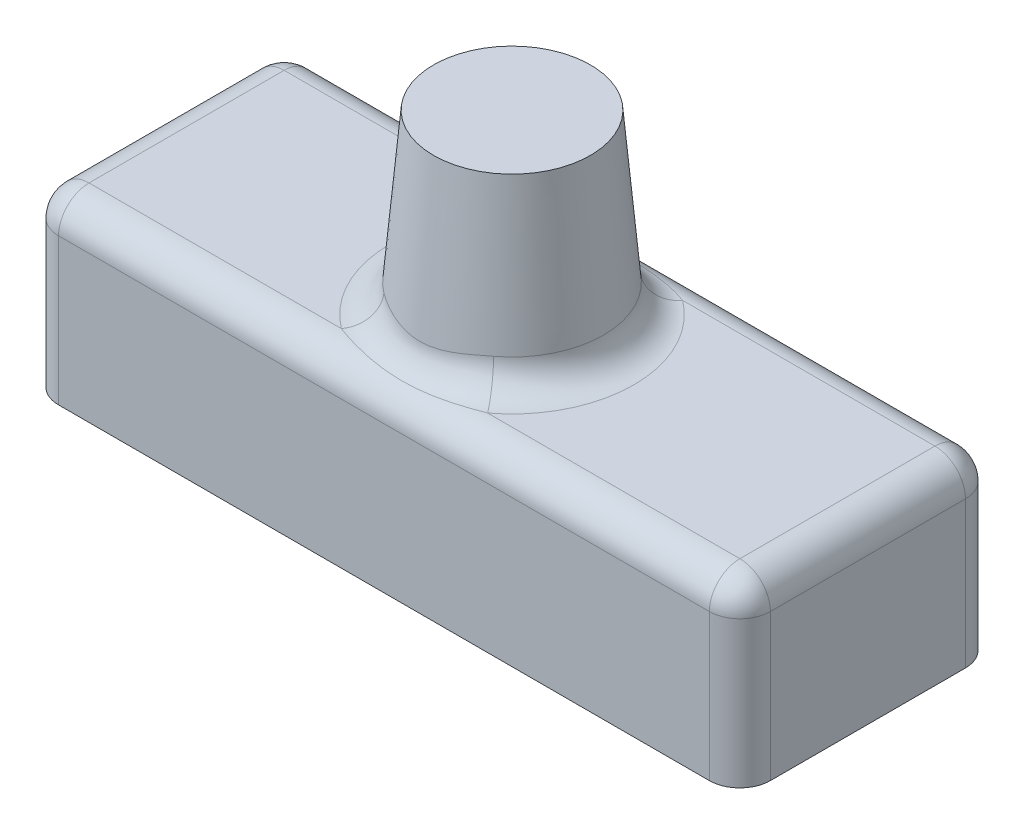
ISO-10303-21;
HEADER;
FILE_DESCRIPTION(('STEP AP214'),'2;1');
FILE_NAME('part.step','',(''),(''),'','','');
FILE_SCHEMA(('AUTOMOTIVE_DESIGN { 1 0 10303 214 1 1 1 1 }'));
ENDSEC;
DATA;
#1=APPLICATION_CONTEXT('core data for automotive mechanical design processes');
#2=APPLICATION_PROTOCOL_DEFINITION('international standard','automotive_design',2000,#1);
#3=PRODUCT_CONTEXT('',#1,'mechanical');
#4=PRODUCT('Part','Part','',(#3));
#5=PRODUCT_RELATED_PRODUCT_CATEGORY('part','',(#4));
#6=PRODUCT_DEFINITION_FORMATION('','',#4);
#7=PRODUCT_DEFINITION_CONTEXT('part definition',#1,'design');
#8=PRODUCT_DEFINITION('design','',#6,#7);
#9=PRODUCT_DEFINITION_SHAPE('','',#8);
#10=(LENGTH_UNIT() NAMED_UNIT(*) SI_UNIT(.MILLI.,.METRE.));
#11=(NAMED_UNIT(*) PLANE_ANGLE_UNIT() SI_UNIT($,.RADIAN.));
#12=(NAMED_UNIT(*) SI_UNIT($,.STERADIAN.) SOLID_ANGLE_UNIT());
#13=UNCERTAINTY_MEASURE_WITH_UNIT(LENGTH_MEASURE(1.E-05),#10,'distance_accuracy_value','');
#14=(GEOMETRIC_REPRESENTATION_CONTEXT(3) GLOBAL_UNCERTAINTY_ASSIGNED_CONTEXT((#13)) GLOBAL_UNIT_ASSIGNED_CONTEXT((#10,
#11,#12)) REPRESENTATION_CONTEXT('',''));
#15=CARTESIAN_POINT('',(0.,0.,0.));
#16=DIRECTION('',(0.,0.,1.));
#17=DIRECTION('',(1.,0.,0.));
#18=AXIS2_PLACEMENT_3D('',#15,#16,#17);
#19=CARTESIAN_POINT('',(-27.0853205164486,14.732,-8.11814470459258));
#20=DIRECTION('',(0.,-1.,0.));
#21=DIRECTION('',(0.,0.,-1.));
#22=AXIS2_PLACEMENT_3D('',#19,#20,#21);
#23=PLANE('',#22);
#24=DIRECTION('',(-1.,0.,0.));
#25=VECTOR('',#24,1.);
#26=CARTESIAN_POINT('',(-27.0853205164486,14.732,-8.11814470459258));
#27=LINE('',#26,#25);
#28=CARTESIAN_POINT('',(27.0853205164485,14.732,-8.11814470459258));
#29=VERTEX_POINT('',#28);
#30=CARTESIAN_POINT('',(6.08559604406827,14.732,-8.11814470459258));
#31=VERTEX_POINT('',#30);
#32=EDGE_CURVE('E207',#29,#31,#27,.T.);
#33=ORIENTED_EDGE('',*,*,#32,.T.);
#34=CARTESIAN_POINT('',(0.,14.732,0.));
#35=DIRECTION('',(0.,-1.,0.));
#36=DIRECTION('',(0.,0.,-1.));
#37=AXIS2_PLACEMENT_3D('',#34,#35,#36);
#38=CIRCLE('',#37,10.1458736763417);
#39=CARTESIAN_POINT('',(6.08559604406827,14.732,8.11814470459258));
#40=VERTEX_POINT('',#39);
#41=EDGE_CURVE('E51',#31,#40,#38,.T.);
#42=ORIENTED_EDGE('',*,*,#41,.T.);
#43=DIRECTION('',(1.,0.,0.));
#44=VECTOR('',#43,1.);
#45=CARTESIAN_POINT('',(-27.0853205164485,14.732,8.11814470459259));
#46=LINE('',#45,#44);
#47=CARTESIAN_POINT('',(27.0853205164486,14.732,8.11814470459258));
#48=VERTEX_POINT('',#47);
#49=EDGE_CURVE('E201',#40,#48,#46,.T.);
#50=ORIENTED_EDGE('',*,*,#49,.T.);
#51=DIRECTION('',(0.,0.,-1.));
#52=VECTOR('',#51,1.);
#53=CARTESIAN_POINT('',(27.0853205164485,14.732,-8.11814470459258));
#54=LINE('',#53,#52);
#55=EDGE_CURVE('E204',#48,#29,#54,.T.);
#56=ORIENTED_EDGE('',*,*,#55,.T.);
#57=EDGE_LOOP('',(#33,#42,#50,#56));
#58=FACE_BOUND('',#57,.T.);
#59=ADVANCED_FACE('F31',(#58),#23,.F.);
#60=CARTESIAN_POINT('',(-27.0853205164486,14.732,8.11814470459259));
#61=VERTEX_POINT('',#60);
#62=CARTESIAN_POINT('',(-6.08559604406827,14.732,8.11814470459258));
#63=VERTEX_POINT('',#62);
#64=EDGE_CURVE('E202',#61,#63,#46,.T.);
#65=ORIENTED_EDGE('',*,*,#64,.T.);
#66=CARTESIAN_POINT('',(0.,14.732,0.));
#67=DIRECTION('',(0.,-1.,0.));
#68=DIRECTION('',(0.,0.,-1.));
#69=AXIS2_PLACEMENT_3D('',#66,#67,#68);
#70=CIRCLE('',#69,10.1458736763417);
#71=CARTESIAN_POINT('',(-6.08559604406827,14.732,-8.11814470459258));
#72=VERTEX_POINT('',#71);
#73=EDGE_CURVE('E437',#63,#72,#70,.T.);
#74=ORIENTED_EDGE('',*,*,#73,.T.);
#75=CARTESIAN_POINT('',(-27.0853205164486,14.732,-8.11814470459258));
#76=VERTEX_POINT('',#75);
#77=EDGE_CURVE('E206',#72,#76,#27,.T.);
#78=ORIENTED_EDGE('',*,*,#77,.T.);
#79=DIRECTION('',(0.,0.,1.));
#80=VECTOR('',#79,1.);
#81=CARTESIAN_POINT('',(-27.0853205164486,14.732,-8.11814470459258));
#82=LINE('',#81,#80);
#83=EDGE_CURVE('E209',#76,#61,#82,.T.);
#84=ORIENTED_EDGE('',*,*,#83,.T.);
#85=EDGE_LOOP('',(#65,#74,#78,#84));
#86=FACE_BOUND('',#85,.T.);
#87=ADVANCED_FACE('F282',(#86),#23,.F.);
#88=CARTESIAN_POINT('',(-27.0853205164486,14.732,-8.11814470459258));
#89=DIRECTION('',(0.,-1.,0.));
#90=DIRECTION('',(0.,0.,-1.));
#91=AXIS2_PLACEMENT_3D('',#88,#89,#90);
#92=CYLINDRICAL_SURFACE('',#91,2.54);
#93=DIRECTION('',(0.,-1.,0.));
#94=VECTOR('',#93,1.);
#95=CARTESIAN_POINT('',(-29.6253205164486,14.732,-8.11814470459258));
#96=LINE('',#95,#94);
#97=CARTESIAN_POINT('',(-29.6253205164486,12.192,-8.11814470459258));
#98=VERTEX_POINT('',#97);
#99=CARTESIAN_POINT('',(-29.6253205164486,0.,-8.11814470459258));
#100=VERTEX_POINT('',#99);
#101=EDGE_CURVE('E138',#98,#100,#96,.T.);
#102=ORIENTED_EDGE('',*,*,#101,.F.);
#103=CARTESIAN_POINT('',(-27.0853205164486,12.192,-8.11814470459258));
#104=DIRECTION('',(0.,-1.,0.));
#105=DIRECTION('',(0.,0.,-1.));
#106=AXIS2_PLACEMENT_3D('',#103,#104,#105);
#107=CIRCLE('',#106,2.54);
#108=CARTESIAN_POINT('',(-27.0853205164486,12.192,-10.6581447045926));
#109=VERTEX_POINT('',#108);
#110=EDGE_CURVE('E213',#98,#109,#107,.T.);
#111=ORIENTED_EDGE('',*,*,#110,.T.);
#112=DIRECTION('',(0.,-1.,0.));
#113=VECTOR('',#112,1.);
#114=CARTESIAN_POINT('',(-27.0853205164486,14.732,-10.6581447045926));
#115=LINE('',#114,#113);
#116=CARTESIAN_POINT('',(-27.0853205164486,0.,-10.6581447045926));
#117=VERTEX_POINT('',#116);
#118=EDGE_CURVE('E163',#109,#117,#115,.T.);
#119=ORIENTED_EDGE('',*,*,#118,.T.);
#120=CARTESIAN_POINT('',(-27.0853205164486,0.,-8.11814470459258));
#121=DIRECTION('',(0.,1.,0.));
#122=DIRECTION('',(0.,0.,-1.));
#123=AXIS2_PLACEMENT_3D('',#120,#121,#122);
#124=CIRCLE('',#123,2.54);
#125=EDGE_CURVE('E156',#117,#100,#124,.T.);
#126=ORIENTED_EDGE('',*,*,#125,.T.);
#127=EDGE_LOOP('',(#102,#111,#119,#126));
#128=FACE_BOUND('',#127,.T.);
#129=ADVANCED_FACE('F161',(#128),#92,.T.);
#130=CARTESIAN_POINT('',(-29.6253205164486,14.732,8.11814470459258));
#131=DIRECTION('',(1.,0.,0.));
#132=DIRECTION('',(0.,0.,-1.));
#133=AXIS2_PLACEMENT_3D('',#130,#131,#132);
#134=PLANE('',#133);
#135=DIRECTION('',(0.,-1.,0.));
#136=VECTOR('',#135,1.);
#137=CARTESIAN_POINT('',(-29.6253205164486,14.732,8.11814470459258));
#138=LINE('',#137,#136);
#139=CARTESIAN_POINT('',(-29.6253205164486,12.192,8.11814470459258));
#140=VERTEX_POINT('',#139);
#141=CARTESIAN_POINT('',(-29.6253205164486,0.,8.11814470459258));
#142=VERTEX_POINT('',#141);
#143=EDGE_CURVE('E150',#140,#142,#138,.T.);
#144=ORIENTED_EDGE('',*,*,#143,.F.);
#145=DIRECTION('',(0.,0.,1.));
#146=VECTOR('',#145,1.);
#147=CARTESIAN_POINT('',(-29.6253205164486,12.192,8.11814470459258));
#148=LINE('',#147,#146);
#149=EDGE_CURVE('E145',#140,#98,#148,.F.);
#150=ORIENTED_EDGE('',*,*,#149,.T.);
#151=ORIENTED_EDGE('',*,*,#101,.T.);
#152=DIRECTION('',(0.,0.,1.));
#153=VECTOR('',#152,1.);
#154=CARTESIAN_POINT('',(-29.6253205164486,0.,8.11814470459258));
#155=LINE('',#154,#153);
#156=EDGE_CURVE('E142',#100,#142,#155,.T.);
#157=ORIENTED_EDGE('',*,*,#156,.T.);
#158=EDGE_LOOP('',(#144,#150,#151,#157));
#159=FACE_BOUND('',#158,.T.);
#160=ADVANCED_FACE('F141',(#159),#134,.F.);
#161=CARTESIAN_POINT('',(-27.0853205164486,14.732,8.11814470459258));
#162=DIRECTION('',(0.,-1.,0.));
#163=DIRECTION('',(0.,0.,-1.));
#164=AXIS2_PLACEMENT_3D('',#161,#162,#163);
#165=CYLINDRICAL_SURFACE('',#164,2.54);
#166=DIRECTION('',(0.,-1.,0.));
#167=VECTOR('',#166,1.);
#168=CARTESIAN_POINT('',(-27.0853205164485,14.732,10.6581447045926));
#169=LINE('',#168,#167);
#170=CARTESIAN_POINT('',(-27.0853205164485,12.192,10.6581447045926));
#171=VERTEX_POINT('',#170);
#172=CARTESIAN_POINT('',(-27.0853205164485,0.,10.6581447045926));
#173=VERTEX_POINT('',#172);
#174=EDGE_CURVE('E196',#171,#173,#169,.T.);
#175=ORIENTED_EDGE('',*,*,#174,.F.);
#176=CARTESIAN_POINT('',(-27.0853205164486,12.192,8.11814470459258));
#177=DIRECTION('',(0.,-1.,0.));
#178=DIRECTION('',(0.,0.,-1.));
#179=AXIS2_PLACEMENT_3D('',#176,#177,#178);
#180=CIRCLE('',#179,2.54);
#181=EDGE_CURVE('E149',#171,#140,#180,.T.);
#182=ORIENTED_EDGE('',*,*,#181,.T.);
#183=ORIENTED_EDGE('',*,*,#143,.T.);
#184=CARTESIAN_POINT('',(-27.0853205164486,0.,8.11814470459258));
#185=DIRECTION('',(0.,1.,0.));
#186=DIRECTION('',(0.,0.,-1.));
#187=AXIS2_PLACEMENT_3D('',#184,#185,#186);
#188=CIRCLE('',#187,2.54);
#189=EDGE_CURVE('E159',#142,#173,#188,.T.);
#190=ORIENTED_EDGE('',*,*,#189,.T.);
#191=EDGE_LOOP('',(#175,#182,#183,#190));
#192=FACE_BOUND('',#191,.T.);
#193=ADVANCED_FACE('F308',(#192),#165,.T.);
#194=CARTESIAN_POINT('',(-27.0853205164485,14.732,10.6581447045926));
#195=DIRECTION('',(0.,0.,-1.));
#196=DIRECTION('',(-1.,0.,0.));
#197=AXIS2_PLACEMENT_3D('',#194,#195,#196);
#198=PLANE('',#197);
#199=DIRECTION('',(0.,-1.,0.));
#200=VECTOR('',#199,1.);
#201=CARTESIAN_POINT('',(27.0853205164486,14.732,10.6581447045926));
#202=LINE('',#201,#200);
#203=CARTESIAN_POINT('',(27.0853205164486,12.192,10.6581447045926));
#204=VERTEX_POINT('',#203);
#205=CARTESIAN_POINT('',(27.0853205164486,0.,10.6581447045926));
#206=VERTEX_POINT('',#205);
#207=EDGE_CURVE('E194',#204,#206,#202,.T.);
#208=ORIENTED_EDGE('',*,*,#207,.F.);
#209=DIRECTION('',(1.,0.,0.));
#210=VECTOR('',#209,1.);
#211=CARTESIAN_POINT('',(-27.0853205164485,12.192,10.6581447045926));
#212=LINE('',#211,#210);
#213=EDGE_CURVE('E223',#204,#171,#212,.F.);
#214=ORIENTED_EDGE('',*,*,#213,.T.);
#215=ORIENTED_EDGE('',*,*,#174,.T.);
#216=DIRECTION('',(1.,0.,0.));
#217=VECTOR('',#216,1.);
#218=CARTESIAN_POINT('',(-27.0853205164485,0.,10.6581447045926));
#219=LINE('',#218,#217);
#220=EDGE_CURVE('E173',#173,#206,#219,.T.);
#221=ORIENTED_EDGE('',*,*,#220,.T.);
#222=EDGE_LOOP('',(#208,#214,#215,#221));
#223=FACE_BOUND('',#222,.T.);
#224=ADVANCED_FACE('F304',(#223),#198,.F.);
#225=CARTESIAN_POINT('',(27.0853205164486,14.732,8.11814470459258));
#226=DIRECTION('',(0.,-1.,0.));
#227=DIRECTION('',(0.,0.,-1.));
#228=AXIS2_PLACEMENT_3D('',#225,#226,#227);
#229=CYLINDRICAL_SURFACE('',#228,2.54);
#230=DIRECTION('',(0.,-1.,0.));
#231=VECTOR('',#230,1.);
#232=CARTESIAN_POINT('',(29.6253205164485,14.732,8.11814470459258));
#233=LINE('',#232,#231);
#234=CARTESIAN_POINT('',(29.6253205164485,12.192,8.11814470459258));
#235=VERTEX_POINT('',#234);
#236=CARTESIAN_POINT('',(29.6253205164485,0.,8.11814470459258));
#237=VERTEX_POINT('',#236);
#238=EDGE_CURVE('E192',#235,#237,#233,.T.);
#239=ORIENTED_EDGE('',*,*,#238,.F.);
#240=CARTESIAN_POINT('',(27.0853205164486,12.192,8.11814470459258));
#241=DIRECTION('',(0.,-1.,0.));
#242=DIRECTION('',(0.,0.,-1.));
#243=AXIS2_PLACEMENT_3D('',#240,#241,#242);
#244=CIRCLE('',#243,2.54);
#245=EDGE_CURVE('E221',#235,#204,#244,.T.);
#246=ORIENTED_EDGE('',*,*,#245,.T.);
#247=ORIENTED_EDGE('',*,*,#207,.T.);
#248=CARTESIAN_POINT('',(27.0853205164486,0.,8.11814470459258));
#249=DIRECTION('',(0.,1.,0.));
#250=DIRECTION('',(0.,0.,1.));
#251=AXIS2_PLACEMENT_3D('',#248,#249,#250);
#252=CIRCLE('',#251,2.54);
#253=EDGE_CURVE('E176',#206,#237,#252,.T.);
#254=ORIENTED_EDGE('',*,*,#253,.T.);
#255=EDGE_LOOP('',(#239,#246,#247,#254));
#256=FACE_BOUND('',#255,.T.);
#257=ADVANCED_FACE('F300',(#256),#229,.T.);
#258=CARTESIAN_POINT('',(29.6253205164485,14.732,8.11814470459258));
#259=DIRECTION('',(-1.,0.,0.));
#260=DIRECTION('',(0.,0.,1.));
#261=AXIS2_PLACEMENT_3D('',#258,#259,#260);
#262=PLANE('',#261);
#263=DIRECTION('',(0.,-1.,0.));
#264=VECTOR('',#263,1.);
#265=CARTESIAN_POINT('',(29.6253205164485,14.732,-8.11814470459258));
#266=LINE('',#265,#264);
#267=CARTESIAN_POINT('',(29.6253205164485,12.192,-8.11814470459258));
#268=VERTEX_POINT('',#267);
#269=CARTESIAN_POINT('',(29.6253205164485,0.,-8.11814470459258));
#270=VERTEX_POINT('',#269);
#271=EDGE_CURVE('E190',#268,#270,#266,.T.);
#272=ORIENTED_EDGE('',*,*,#271,.F.);
#273=DIRECTION('',(0.,0.,-1.));
#274=VECTOR('',#273,1.);
#275=CARTESIAN_POINT('',(29.6253205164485,12.192,8.11814470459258));
#276=LINE('',#275,#274);
#277=EDGE_CURVE('E219',#268,#235,#276,.F.);
#278=ORIENTED_EDGE('',*,*,#277,.T.);
#279=ORIENTED_EDGE('',*,*,#238,.T.);
#280=DIRECTION('',(0.,0.,-1.));
#281=VECTOR('',#280,1.);
#282=CARTESIAN_POINT('',(29.6253205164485,0.,8.11814470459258));
#283=LINE('',#282,#281);
#284=EDGE_CURVE('E179',#237,#270,#283,.T.);
#285=ORIENTED_EDGE('',*,*,#284,.T.);
#286=EDGE_LOOP('',(#272,#278,#279,#285));
#287=FACE_BOUND('',#286,.T.);
#288=ADVANCED_FACE('F296',(#287),#262,.F.);
#289=CARTESIAN_POINT('',(27.0853205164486,14.732,-8.11814470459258));
#290=DIRECTION('',(0.,-1.,0.));
#291=DIRECTION('',(0.,0.,-1.));
#292=AXIS2_PLACEMENT_3D('',#289,#290,#291);
#293=CYLINDRICAL_SURFACE('',#292,2.54);
#294=DIRECTION('',(0.,-1.,0.));
#295=VECTOR('',#294,1.);
#296=CARTESIAN_POINT('',(27.0853205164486,14.732,-10.6581447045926));
#297=LINE('',#296,#295);
#298=CARTESIAN_POINT('',(27.0853205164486,12.192,-10.6581447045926));
#299=VERTEX_POINT('',#298);
#300=CARTESIAN_POINT('',(27.0853205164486,0.,-10.6581447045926));
#301=VERTEX_POINT('',#300);
#302=EDGE_CURVE('E188',#299,#301,#297,.T.);
#303=ORIENTED_EDGE('',*,*,#302,.F.);
#304=CARTESIAN_POINT('',(27.0853205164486,12.192,-8.11814470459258));
#305=DIRECTION('',(0.,-1.,0.));
#306=DIRECTION('',(0.,0.,-1.));
#307=AXIS2_PLACEMENT_3D('',#304,#305,#306);
#308=CIRCLE('',#307,2.54);
#309=EDGE_CURVE('E217',#299,#268,#308,.T.);
#310=ORIENTED_EDGE('',*,*,#309,.T.);
#311=ORIENTED_EDGE('',*,*,#271,.T.);
#312=CARTESIAN_POINT('',(27.0853205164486,0.,-8.11814470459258));
#313=DIRECTION('',(0.,1.,0.));
#314=DIRECTION('',(0.,0.,-1.));
#315=AXIS2_PLACEMENT_3D('',#312,#313,#314);
#316=CIRCLE('',#315,2.54);
#317=EDGE_CURVE('E182',#270,#301,#316,.T.);
#318=ORIENTED_EDGE('',*,*,#317,.T.);
#319=EDGE_LOOP('',(#303,#310,#311,#318));
#320=FACE_BOUND('',#319,.T.);
#321=ADVANCED_FACE('F292',(#320),#293,.T.);
#322=CARTESIAN_POINT('',(-27.0853205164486,14.732,-10.6581447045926));
#323=DIRECTION('',(0.,0.,1.));
#324=DIRECTION('',(1.,0.,0.));
#325=AXIS2_PLACEMENT_3D('',#322,#323,#324);
#326=PLANE('',#325);
#327=ORIENTED_EDGE('',*,*,#118,.F.);
#328=DIRECTION('',(-1.,0.,0.));
#329=VECTOR('',#328,1.);
#330=CARTESIAN_POINT('',(-27.0853205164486,12.192,-10.6581447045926));
#331=LINE('',#330,#329);
#332=EDGE_CURVE('E215',#109,#299,#331,.F.);
#333=ORIENTED_EDGE('',*,*,#332,.T.);
#334=ORIENTED_EDGE('',*,*,#302,.T.);
#335=DIRECTION('',(-1.,0.,0.));
#336=VECTOR('',#335,1.);
#337=CARTESIAN_POINT('',(-27.0853205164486,0.,-10.6581447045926));
#338=LINE('',#337,#336);
#339=EDGE_CURVE('E185',#301,#117,#338,.T.);
#340=ORIENTED_EDGE('',*,*,#339,.T.);
#341=EDGE_LOOP('',(#327,#333,#334,#340));
#342=FACE_BOUND('',#341,.T.);
#343=ADVANCED_FACE('F289',(#342),#326,.F.);
#344=CARTESIAN_POINT('',(-27.0853205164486,0.,-8.11814470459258));
#345=DIRECTION('',(0.,-1.,0.));
#346=DIRECTION('',(0.,0.,-1.));
#347=AXIS2_PLACEMENT_3D('',#344,#345,#346);
#348=PLANE('',#347);
#349=ORIENTED_EDGE('',*,*,#125,.F.);
#350=ORIENTED_EDGE('',*,*,#339,.F.);
#351=ORIENTED_EDGE('',*,*,#317,.F.);
#352=ORIENTED_EDGE('',*,*,#284,.F.);
#353=ORIENTED_EDGE('',*,*,#253,.F.);
#354=ORIENTED_EDGE('',*,*,#220,.F.);
#355=ORIENTED_EDGE('',*,*,#189,.F.);
#356=ORIENTED_EDGE('',*,*,#156,.F.);
#357=EDGE_LOOP('',(#349,#350,#351,#352,#353,#354,#355,#356));
#358=FACE_BOUND('',#357,.T.);
#359=ADVANCED_FACE('F154',(#358),#348,.T.);
#360=CARTESIAN_POINT('',(0.,14.732,0.));
#361=DIRECTION('',(0.,-1.,0.));
#362=DIRECTION('',(0.,0.,1.));
#363=AXIS2_PLACEMENT_3D('',#360,#361,#362);
#364=CONICAL_SURFACE('',#363,7.81839249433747,0.0872664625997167);
#365=CARTESIAN_POINT('',(0.,17.0506244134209,0.));
#366=DIRECTION('',(0.,-1.,0.));
#367=DIRECTION('',(0.,0.,-1.));
#368=AXIS2_PLACEMENT_3D('',#365,#366,#367);
#369=CIRCLE('',#368,7.61553914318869);
#370=CARTESIAN_POINT('',(4.56787619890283,17.0506244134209,6.09351651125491));
#371=VERTEX_POINT('',#370);
#372=CARTESIAN_POINT('',(4.56787619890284,17.0506244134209,-6.0935165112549));
#373=VERTEX_POINT('',#372);
#374=EDGE_CURVE('E225',#371,#373,#369,.F.);
#375=ORIENTED_EDGE('',*,*,#374,.T.);
#376=CARTESIAN_POINT('',(5.96605950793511,16.7362566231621,-4.77726245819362));
#377=CARTESIAN_POINT('',(5.66075203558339,13.9508985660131,-5.54841428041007));
#378=CARTESIAN_POINT('',(7.94120564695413,14.5748161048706,-7.23849283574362));
#379=CARTESIAN_POINT('',(5.86387156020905,16.7953519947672,-4.89670916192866));
#380=CARTESIAN_POINT('',(5.60397410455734,14.0275683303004,-5.5826449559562));
#381=CARTESIAN_POINT('',(7.80652336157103,14.6043637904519,-7.31852468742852));
#382=CARTESIAN_POINT('',(5.75738906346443,16.8446472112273,-5.01494193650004));
#383=CARTESIAN_POINT('',(5.54166896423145,14.1040195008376,-5.62523290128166));
#384=CARTESIAN_POINT('',(7.6658365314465,14.6290113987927,-7.39769855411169));
#385=CARTESIAN_POINT('',(5.53682562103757,16.9258950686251,-5.24705896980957));
#386=CARTESIAN_POINT('',(5.40494743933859,14.2514476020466,-5.72413243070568));
#387=CARTESIAN_POINT('',(7.37387227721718,14.6696353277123,-7.55303742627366));
#388=CARTESIAN_POINT('',(5.42276124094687,16.9578842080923,-5.36095190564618));
#389=CARTESIAN_POINT('',(5.33089214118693,14.3224162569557,-5.78008077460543));
#390=CARTESIAN_POINT('',(7.22261790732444,14.685629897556,-7.62920844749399));
#391=CARTESIAN_POINT('',(5.18878072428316,17.0067583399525,-5.58186012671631));
#392=CARTESIAN_POINT('',(5.16989412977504,14.4553445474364,-5.90242620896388));
#393=CARTESIAN_POINT('',(6.9119442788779,14.7100669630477,-7.7768430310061));
#394=CARTESIAN_POINT('',(5.06893585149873,17.0237935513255,-5.68893355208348));
#395=CARTESIAN_POINT('',(5.0834253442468,14.5174781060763,-5.96844430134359));
#396=CARTESIAN_POINT('',(6.75262363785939,14.7185845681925,-7.84834657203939));
#397=CARTESIAN_POINT('',(4.82296119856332,17.0457299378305,-5.89643123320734));
#398=CARTESIAN_POINT('',(4.89684325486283,14.6318951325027,-6.10755214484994));
#399=CARTESIAN_POINT('',(6.4253504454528,14.7295527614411,-7.98680307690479));
#400=CARTESIAN_POINT('',(4.69682754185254,17.0506235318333,-5.99685129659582));
#401=CARTESIAN_POINT('',(4.79699128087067,14.684351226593,-6.18050372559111));
#402=CARTESIAN_POINT('',(6.25739256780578,14.731999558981,-8.05375317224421));
#403=CARTESIAN_POINT('',(4.40421359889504,17.0506255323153,-6.21620216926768));
#404=CARTESIAN_POINT('',(4.55602891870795,14.7912144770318,-6.3494358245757));
#405=CARTESIAN_POINT('',(5.86755515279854,14.7320005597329,-8.19986921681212));
#406=CARTESIAN_POINT('',(4.23601221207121,17.042745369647,-6.33283943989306));
#407=CARTESIAN_POINT('',(4.41064716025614,14.8430653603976,-6.44680555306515));
#408=CARTESIAN_POINT('',(5.64333089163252,14.7280604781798,-8.27747234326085));
#409=CARTESIAN_POINT('',(3.8916205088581,17.0158736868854,-6.55284868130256));
#410=CARTESIAN_POINT('',(4.10053787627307,14.9306070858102,-6.64011121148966));
#411=CARTESIAN_POINT('',(5.18412316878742,14.7146246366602,-8.42368791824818));
#412=CARTESIAN_POINT('',(3.71542894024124,16.9968804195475,-6.65621856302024));
#413=CARTESIAN_POINT('',(3.93599348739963,14.9667035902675,-6.73621840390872));
#414=CARTESIAN_POINT('',(4.9491380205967,14.7051280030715,-8.49229895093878));
#415=CARTESIAN_POINT('',(3.35514947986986,16.9520600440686,-6.84928997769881));
#416=CARTESIAN_POINT('',(3.589328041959,15.0252401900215,-6.92188683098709));
#417=CARTESIAN_POINT('',(4.46865309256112,14.6827178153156,-8.62030495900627));
#418=CARTESIAN_POINT('',(3.17103043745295,16.9262034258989,-6.93892978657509));
#419=CARTESIAN_POINT('',(3.40708266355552,15.0479473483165,-7.01175088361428));
#420=CARTESIAN_POINT('',(4.22311184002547,14.6697895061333,-8.67965833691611));
#421=CARTESIAN_POINT('',(2.79640731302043,16.8718614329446,-7.10329758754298));
#422=CARTESIAN_POINT('',(3.02825084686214,15.0826104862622,-7.18018529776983));
#423=CARTESIAN_POINT('',(3.72361628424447,14.6426185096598,-8.78837553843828));
#424=CARTESIAN_POINT('',(2.605902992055,16.8433759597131,-7.17802502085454));
#425=CARTESIAN_POINT('',(2.83142068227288,15.0947853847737,-7.25915202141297));
#426=CARTESIAN_POINT('',(3.46966166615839,14.6283757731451,-8.83773898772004));
#427=CARTESIAN_POINT('',(2.21566571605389,16.7871405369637,-7.31316117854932));
#428=CARTESIAN_POINT('',(2.42230700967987,15.1119191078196,-7.40386522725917));
#429=CARTESIAN_POINT('',(2.94959856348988,14.6002580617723,-8.92692336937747));
#430=CARTESIAN_POINT('',(2.01582633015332,16.7594147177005,-7.37327207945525));
#431=CARTESIAN_POINT('',(2.20930441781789,15.1168677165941,-7.46977022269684));
#432=CARTESIAN_POINT('',(2.68335101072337,14.5863951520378,-8.96654597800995));
#433=CARTESIAN_POINT('',(1.61141210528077,16.7089908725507,-7.4765945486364));
#434=CARTESIAN_POINT('',(1.77414051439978,15.1224871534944,-7.58385676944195));
#435=CARTESIAN_POINT('',(2.14470641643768,14.5611832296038,-9.03460064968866));
#436=CARTESIAN_POINT('',(1.40683739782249,16.686292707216,-7.51980658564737));
#437=CARTESIAN_POINT('',(1.55136768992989,15.1232113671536,-7.6324068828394));
#438=CARTESIAN_POINT('',(1.87230954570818,14.5498341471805,-9.0630330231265));
#439=CARTESIAN_POINT('',(0.994901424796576,16.6490326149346,-7.58857336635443));
#440=CARTESIAN_POINT('',(1.10050976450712,15.1231800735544,-7.70982936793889));
#441=CARTESIAN_POINT('',(1.32393414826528,14.5312041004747,-9.10825811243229));
#442=CARTESIAN_POINT('',(0.787550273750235,16.6344466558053,-7.61418031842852));
#443=CARTESIAN_POINT('',(0.871712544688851,15.1224390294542,-7.73902601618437));
#444=CARTESIAN_POINT('',(1.04796870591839,14.5239111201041,-9.12508524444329));
#445=CARTESIAN_POINT('',(0.371139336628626,16.6153149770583,-7.64747183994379));
#446=CARTESIAN_POINT('',(0.411633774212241,15.1213047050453,-7.77690659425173));
#447=CARTESIAN_POINT('',(0.493832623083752,14.5143452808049,-9.14695890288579));
#448=CARTESIAN_POINT('',(0.162079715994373,16.6107682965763,-7.65515812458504));
#449=CARTESIAN_POINT('',(0.179537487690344,15.1209082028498,-7.78572862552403));
#450=CARTESIAN_POINT('',(0.215662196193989,14.512071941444,-9.1520065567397));
#451=CARTESIAN_POINT('',(-0.247124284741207,16.6123105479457,-7.65251633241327));
#452=CARTESIAN_POINT('',(-0.273821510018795,15.1210228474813,-7.78271554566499));
#453=CARTESIAN_POINT('',(-0.328821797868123,14.5128430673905,-9.1502712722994));
#454=CARTESIAN_POINT('',(-0.447274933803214,16.6179615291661,-7.64293007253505));
#455=CARTESIAN_POINT('',(-0.495888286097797,15.1214970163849,-7.77172169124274));
#456=CARTESIAN_POINT('',(-0.595143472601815,14.5156685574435,-9.14397550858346));
#457=CARTESIAN_POINT('',(-0.845825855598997,16.6383229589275,-7.60734893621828));
#458=CARTESIAN_POINT('',(-0.935932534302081,15.1226214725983,-7.7312655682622));
#459=CARTESIAN_POINT('',(-1.12552698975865,14.5258492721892,-9.12059585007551));
#460=CARTESIAN_POINT('',(-1.04422608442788,16.6530336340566,-7.58135364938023));
#461=CARTESIAN_POINT('',(-1.15462084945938,15.1232742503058,-7.7016698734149));
#462=CARTESIAN_POINT('',(-1.38958877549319,14.533204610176,-9.1035116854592));
#463=CARTESIAN_POINT('',(-1.43838843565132,16.689715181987,-7.51328938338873));
#464=CARTESIAN_POINT('',(-1.58565004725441,15.1231031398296,-7.62511388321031));
#465=CARTESIAN_POINT('',(-1.91431948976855,14.5515453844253,-9.05874487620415));
#466=CARTESIAN_POINT('',(-1.63414159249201,16.7117063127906,-7.47117550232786));
#467=CARTESIAN_POINT('',(-1.7986102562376,15.1222645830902,-7.5778632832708));
#468=CARTESIAN_POINT('',(-2.17497681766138,14.5625409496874,-9.03103262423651));
#469=CARTESIAN_POINT('',(-2.02128580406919,16.7602232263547,-7.37145978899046));
#470=CARTESIAN_POINT('',(-2.2149853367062,15.116693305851,-7.46782247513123));
#471=CARTESIAN_POINT('',(-2.6906261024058,14.5867994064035,-8.96535089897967));
#472=CARTESIAN_POINT('',(-2.21267660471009,16.7867492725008,-7.31385705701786));
#473=CARTESIAN_POINT('',(-2.41893407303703,15.1119123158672,-7.40470647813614));
#474=CARTESIAN_POINT('',(-2.94561772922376,14.6000624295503,-8.92738082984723));
#475=CARTESIAN_POINT('',(-2.59573062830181,16.8418716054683,-7.18187706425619));
#476=CARTESIAN_POINT('',(-2.82087852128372,15.0953722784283,-7.26322734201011));
#477=CARTESIAN_POINT('',(-3.45610248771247,14.627623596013,-8.84028291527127));
#478=CARTESIAN_POINT('',(-2.7872362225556,16.8705058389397,-7.1070561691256));
#479=CARTESIAN_POINT('',(-3.01886924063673,15.0832941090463,-7.18409925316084));
#480=CARTESIAN_POINT('',(-3.71138968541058,14.6419407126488,-8.79085968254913));
#481=CARTESIAN_POINT('',(-3.16381407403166,16.9251807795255,-6.94234996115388));
#482=CARTESIAN_POINT('',(-3.39991355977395,15.048773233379,-7.01518883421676));
#483=CARTESIAN_POINT('',(-4.21348864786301,14.6692781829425,-8.68192232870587));
#484=CARTESIAN_POINT('',(-3.34888645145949,16.9512215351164,-6.85246492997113));
#485=CARTESIAN_POINT('',(-3.58321680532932,15.0261098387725,-6.92500382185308));
#486=CARTESIAN_POINT('',(-4.46030057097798,14.6822985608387,-8.62240839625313));
#487=CARTESIAN_POINT('',(-3.71105149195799,16.9963932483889,-6.65873977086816));
#488=CARTESIAN_POINT('',(-3.93189473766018,14.967555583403,-6.73856757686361));
#489=CARTESIAN_POINT('',(-4.94329992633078,14.704884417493,-8.49397200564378));
#490=CARTESIAN_POINT('',(-3.88817389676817,17.0155522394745,-6.5549586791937));
#491=CARTESIAN_POINT('',(-4.09739245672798,14.9313913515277,-6.64200696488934));
#492=CARTESIAN_POINT('',(-5.17952695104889,14.714463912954,-8.42508933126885));
#493=CARTESIAN_POINT('',(-4.23435004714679,17.0426674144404,-6.33399168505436));
#494=CARTESIAN_POINT('',(-4.4092257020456,14.843570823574,-6.44775700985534));
#495=CARTESIAN_POINT('',(-5.64111512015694,14.7280215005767,-8.27823896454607));
#496=CARTESIAN_POINT('',(-4.40340519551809,17.0506255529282,-6.21680812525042));
#497=CARTESIAN_POINT('',(-4.55537686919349,14.7915033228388,-6.34989283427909));
#498=CARTESIAN_POINT('',(-5.8664781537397,14.7320005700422,-8.20027285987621));
#499=CARTESIAN_POINT('',(-4.69684195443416,17.0506235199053,-5.99684052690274));
#500=CARTESIAN_POINT('',(-4.79700360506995,14.6843460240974,-6.18049518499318));
#501=CARTESIAN_POINT('',(-6.25741176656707,14.7319995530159,-8.05374599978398));
#502=CARTESIAN_POINT('',(-4.82298914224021,17.0457288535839,-5.89640899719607));
#503=CARTESIAN_POINT('',(-4.89686564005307,14.6318834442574,-6.10753581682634));
#504=CARTESIAN_POINT('',(-6.42538765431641,14.7295522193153,-7.98678825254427));
#505=CARTESIAN_POINT('',(-5.06898951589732,17.0237873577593,-5.68888694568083));
#506=CARTESIAN_POINT('',(-5.08346522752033,14.5174515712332,-5.96841419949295));
#507=CARTESIAN_POINT('',(-6.75269500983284,14.7185814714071,-7.84831546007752));
#508=CARTESIAN_POINT('',(-5.18884658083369,17.0067481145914,-5.58180061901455));
#509=CARTESIAN_POINT('',(-5.16994136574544,14.4553096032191,-5.90239017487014));
#510=CARTESIAN_POINT('',(-6.91203180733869,14.7100618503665,-7.77680328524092));
#511=CARTESIAN_POINT('',(-5.42282406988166,16.9578675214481,-5.36088989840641));
#512=CARTESIAN_POINT('',(-5.33093336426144,14.3223780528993,-5.780049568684));
#513=CARTESIAN_POINT('',(-7.22270124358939,14.6856215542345,-7.62916698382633));
#514=CARTESIAN_POINT('',(-5.53687475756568,16.9258791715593,-5.2470086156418));
#515=CARTESIAN_POINT('',(-5.40497853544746,14.2514160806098,-5.72410940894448));
#516=CARTESIAN_POINT('',(-7.37393737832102,14.6696273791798,-7.55300373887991));
#517=CARTESIAN_POINT('',(-5.75741236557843,16.8446364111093,-5.01491603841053));
#518=CARTESIAN_POINT('',(-5.54168241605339,14.1040029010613,-5.62522374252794));
#519=CARTESIAN_POINT('',(-7.6658673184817,14.6290059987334,-7.39768121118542));
#520=CARTESIAN_POINT('',(-5.8638827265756,16.7953455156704,-4.89669607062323));
#521=CARTESIAN_POINT('',(-5.60398016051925,14.0275599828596,-5.58264136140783));
#522=CARTESIAN_POINT('',(-7.80653807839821,14.6043605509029,-7.31851591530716));
#523=CARTESIAN_POINT('',(-5.96605950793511,16.7362566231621,-4.77726245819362));
#524=CARTESIAN_POINT('',(-5.66075203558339,13.9508985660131,-5.54841428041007));
#525=CARTESIAN_POINT('',(-7.94120564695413,14.5748161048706,-7.23849283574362));
#526=(BOUNDED_SURFACE() B_SPLINE_SURFACE(3,2,((#376,#377,#378),(#379,#380,#381),(#382,#383,
#384),(#385,#386,#387),(#388,#389,#390),(#391,#392,#393),(#394,#395,#396),(#397,#398,#399),
(#400,#401,#402),(#403,#404,#405),(#406,#407,#408),(#409,#410,#411),(#412,#413,#414),(#415,#416,
#417),(#418,#419,#420),(#421,#422,#423),(#424,#425,#426),(#427,#428,#429),(#430,#431,#432),
(#433,#434,#435),(#436,#437,#438),(#439,#440,#441),(#442,#443,#444),(#445,#446,#447),(#448,#449,
#450),(#451,#452,#453),(#454,#455,#456),(#457,#458,#459),(#460,#461,#462),(#463,#464,#465),
(#466,#467,#468),(#469,#470,#471),(#472,#473,#474),(#475,#476,#477),(#478,#479,#480),(#481,#482,
#483),(#484,#485,#486),(#487,#488,#489),(#490,#491,#492),(#493,#494,#495),(#496,#497,#498),
(#499,#500,#501),(#502,#503,#504),(#505,#506,#507),(#508,#509,#510),(#511,#512,#513),(#514,#515,
#516),(#517,#518,#519),(#520,#521,#522),(#523,#524,#525)),.UNSPECIFIED.,.F.,.F.,
.F.) B_SPLINE_SURFACE_WITH_KNOTS((4,2,2,2,2,2,2,2,2,2,2,2,2,2,2,2,2,2,2,2,2,2,2,2,4),(3,3),(0.,
0.651521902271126,1.30166433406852,1.94519848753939,2.58913435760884,3.40640555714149,
4.22380528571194,5.04477813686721,5.86578174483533,6.702326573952,7.53884819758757,
8.3728782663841,9.2068285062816,10.0058117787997,10.8048150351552,11.606060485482,
12.4073524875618,13.2322176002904,14.0570672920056,14.8785177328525,15.699824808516,
16.343831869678,16.9874369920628,17.6375085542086,18.2889592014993),(0.,1.),
.UNSPECIFIED.) GEOMETRIC_REPRESENTATION_ITEM() RATIONAL_B_SPLINE_SURFACE(((1.,0.658072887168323,
1.),(1.,0.663801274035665,1.),(1.,0.669923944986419,1.),(1.,0.682694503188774,1.),(1.,
0.689341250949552,1.),(1.,0.702853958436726,1.),(1.,0.709717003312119,1.),(1.,0.723502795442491,
1.),(1.,0.73042557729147,1.),(1.,0.745973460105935,1.),(1.,0.754555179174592,1.),(1.,
0.771154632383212,1.),(1.,0.779172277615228,1.),(1.,0.794418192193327,1.),(1.,0.801642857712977,
1.),(1.,0.815057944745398,1.),(1.,0.821248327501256,1.),(1.,0.832538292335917,1.),(1.,
0.837615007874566,1.),(1.,0.846388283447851,1.),(1.,0.850084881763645,1.),(1.,0.855984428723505,
1.),(1.,0.858191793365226,1.),(1.,0.861063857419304,1.),(1.,0.861728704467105,1.),(1.,
0.861500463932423,1.),(1.,0.860671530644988,1.),(1.,0.857603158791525,1.),(1.,0.855363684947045,
1.),(1.,0.84952744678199,1.),(1.,0.845926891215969,1.),(1.,0.837462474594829,1.),(1.,
0.832598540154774,1.),(1.,0.821568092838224,1.),(1.,0.815367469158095,1.),(1.,0.801919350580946,
1.),(1.,0.794671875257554,1.),(1.,0.779368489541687,1.),(1.,0.771316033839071,1.),(1.,
0.754639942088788,1.),(1.,0.746016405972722,1.),(1.,0.730424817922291,1.),(1.,0.723501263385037,
1.),(1.,0.709713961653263,1.),(1.,0.7028501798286,1.),(1.,0.689337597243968,1.),(1.,
0.682691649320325,1.),(1.,0.669922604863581,1.),(1.,0.663800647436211,1.),(1.,0.658072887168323,1.))) REPRESENTATION_ITEM('') SURFACE());
#527=CARTESIAN_POINT('',(5.96605950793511,16.7362566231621,-4.77726245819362));
#528=CARTESIAN_POINT('',(5.86387156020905,16.7953519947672,-4.89670916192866));
#529=CARTESIAN_POINT('',(5.75738906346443,16.8446472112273,-5.01494193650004));
#530=CARTESIAN_POINT('',(5.53682562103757,16.9258950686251,-5.24705896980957));
#531=CARTESIAN_POINT('',(5.42276124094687,16.9578842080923,-5.36095190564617));
#532=CARTESIAN_POINT('',(5.18878072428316,17.0067583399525,-5.58186012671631));
#533=CARTESIAN_POINT('',(5.06893585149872,17.0237935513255,-5.68893355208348));
#534=CARTESIAN_POINT('',(4.82296119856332,17.0457299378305,-5.89643123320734));
#535=CARTESIAN_POINT('',(4.69682754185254,17.0506235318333,-5.99685129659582));
#536=CARTESIAN_POINT('',(4.40421359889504,17.0506255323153,-6.21620216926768));
#537=CARTESIAN_POINT('',(4.23601221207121,17.042745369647,-6.33283943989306));
#538=CARTESIAN_POINT('',(3.8916205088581,17.0158736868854,-6.55284868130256));
#539=CARTESIAN_POINT('',(3.71542894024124,16.9968804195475,-6.65621856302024));
#540=CARTESIAN_POINT('',(3.35514947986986,16.9520600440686,-6.84928997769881));
#541=CARTESIAN_POINT('',(3.17103043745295,16.9262034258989,-6.93892978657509));
#542=CARTESIAN_POINT('',(2.79640731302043,16.8718614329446,-7.10329758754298));
#543=CARTESIAN_POINT('',(2.605902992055,16.8433759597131,-7.17802502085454));
#544=CARTESIAN_POINT('',(2.21566571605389,16.7871405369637,-7.31316117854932));
#545=CARTESIAN_POINT('',(2.01582633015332,16.7594147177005,-7.37327207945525));
#546=CARTESIAN_POINT('',(1.61141210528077,16.7089908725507,-7.4765945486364));
#547=CARTESIAN_POINT('',(1.40683739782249,16.686292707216,-7.51980658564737));
#548=CARTESIAN_POINT('',(0.994901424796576,16.6490326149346,-7.58857336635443));
#549=CARTESIAN_POINT('',(0.787550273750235,16.6344466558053,-7.61418031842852));
#550=CARTESIAN_POINT('',(0.371139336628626,16.6153149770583,-7.6474718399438));
#551=CARTESIAN_POINT('',(0.162079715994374,16.6107682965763,-7.65515812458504));
#552=CARTESIAN_POINT('',(-0.247124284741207,16.6123105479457,-7.65251633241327));
#553=CARTESIAN_POINT('',(-0.447274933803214,16.6179615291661,-7.64293007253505));
#554=CARTESIAN_POINT('',(-0.845825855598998,16.6383229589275,-7.60734893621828));
#555=CARTESIAN_POINT('',(-1.04422608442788,16.6530336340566,-7.58135364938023));
#556=CARTESIAN_POINT('',(-1.43838843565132,16.689715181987,-7.51328938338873));
#557=CARTESIAN_POINT('',(-1.63414159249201,16.7117063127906,-7.47117550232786));
#558=CARTESIAN_POINT('',(-2.02128580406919,16.7602232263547,-7.37145978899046));
#559=CARTESIAN_POINT('',(-2.21267660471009,16.7867492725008,-7.31385705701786));
#560=CARTESIAN_POINT('',(-2.59573062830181,16.8418716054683,-7.18187706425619));
#561=CARTESIAN_POINT('',(-2.7872362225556,16.8705058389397,-7.1070561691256));
#562=CARTESIAN_POINT('',(-3.16381407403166,16.9251807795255,-6.94234996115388));
#563=CARTESIAN_POINT('',(-3.34888645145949,16.9512215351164,-6.85246492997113));
#564=CARTESIAN_POINT('',(-3.71105149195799,16.9963932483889,-6.65873977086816));
#565=CARTESIAN_POINT('',(-3.88817389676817,17.0155522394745,-6.5549586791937));
#566=CARTESIAN_POINT('',(-4.23435004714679,17.0426674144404,-6.33399168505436));
#567=CARTESIAN_POINT('',(-4.40340519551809,17.0506255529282,-6.21680812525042));
#568=CARTESIAN_POINT('',(-4.69684195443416,17.0506235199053,-5.99684052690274));
#569=CARTESIAN_POINT('',(-4.82298914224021,17.0457288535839,-5.89640899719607));
#570=CARTESIAN_POINT('',(-5.06898951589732,17.0237873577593,-5.68888694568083));
#571=CARTESIAN_POINT('',(-5.18884658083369,17.0067481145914,-5.58180061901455));
#572=CARTESIAN_POINT('',(-5.42282406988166,16.9578675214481,-5.36088989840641));
#573=CARTESIAN_POINT('',(-5.53687475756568,16.9258791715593,-5.2470086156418));
#574=CARTESIAN_POINT('',(-5.75741236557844,16.8446364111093,-5.01491603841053));
#575=CARTESIAN_POINT('',(-5.86388272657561,16.7953455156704,-4.89669607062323));
#576=CARTESIAN_POINT('',(-5.96605950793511,16.7362566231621,-4.77726245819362));
#577=B_SPLINE_CURVE_WITH_KNOTS('',3,(#527,#528,#529,#530,#531,#532,#533,#534,#535,#536,#537,
#538,#539,#540,#541,#542,#543,#544,#545,#546,#547,#548,#549,#550,#551,#552,#553,#554,#555,#556,
#557,#558,#559,#560,#561,#562,#563,#564,#565,#566,#567,#568,#569,#570,#571,#572,#573,#574,#575,
#576),.UNSPECIFIED.,.F.,.F.,(4,2,2,2,2,2,2,2,2,2,2,2,2,2,2,2,2,2,2,2,2,2,2,2,4),(0.,
0.651521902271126,1.30166433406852,1.94519848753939,2.58913435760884,3.40640555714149,
4.22380528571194,5.04477813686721,5.86578174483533,6.702326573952,7.53884819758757,
8.3728782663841,9.2068285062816,10.0058117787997,10.8048150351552,11.606060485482,
12.4073524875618,13.2322176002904,14.0570672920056,14.8785177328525,15.699824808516,
16.343831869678,16.9874369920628,17.6375085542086,18.2889592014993),.UNSPECIFIED.);
#578=CARTESIAN_POINT('',(-4.56787619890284,17.0506244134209,-6.0935165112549));
#579=VERTEX_POINT('',#578);
#580=EDGE_CURVE('E433',#373,#579,#577,.T.);
#581=ORIENTED_EDGE('',*,*,#580,.T.);
#582=CARTESIAN_POINT('',(0.,17.0506244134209,0.));
#583=DIRECTION('',(0.,-1.,0.));
#584=DIRECTION('',(0.,0.,-1.));
#585=AXIS2_PLACEMENT_3D('',#582,#583,#584);
#586=CIRCLE('',#585,7.61553914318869);
#587=CARTESIAN_POINT('',(-4.56787619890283,17.0506244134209,6.09351651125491));
#588=VERTEX_POINT('',#587);
#589=EDGE_CURVE('E234',#579,#588,#586,.F.);
#590=ORIENTED_EDGE('',*,*,#589,.T.);
#591=CARTESIAN_POINT('',(-5.96605950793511,16.7362566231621,4.77726245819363));
#592=CARTESIAN_POINT('',(-5.66075203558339,13.9508985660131,5.54841428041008));
#593=CARTESIAN_POINT('',(-7.94120564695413,14.5748161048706,7.23849283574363));
#594=CARTESIAN_POINT('',(-5.86387156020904,16.7953519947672,4.89670916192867));
#595=CARTESIAN_POINT('',(-5.60397410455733,14.0275683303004,5.58264495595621));
#596=CARTESIAN_POINT('',(-7.80652336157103,14.6043637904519,7.31852468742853));
#597=CARTESIAN_POINT('',(-5.75738906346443,16.8446472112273,5.01494193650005));
#598=CARTESIAN_POINT('',(-5.54166896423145,14.1040195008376,5.62523290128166));
#599=CARTESIAN_POINT('',(-7.6658365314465,14.6290113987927,7.3976985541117));
#600=CARTESIAN_POINT('',(-5.53682562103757,16.9258950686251,5.24705896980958));
#601=CARTESIAN_POINT('',(-5.40494743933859,14.2514476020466,5.72413243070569));
#602=CARTESIAN_POINT('',(-7.37387227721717,14.6696353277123,7.55303742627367));
#603=CARTESIAN_POINT('',(-5.42276124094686,16.9578842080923,5.36095190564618));
#604=CARTESIAN_POINT('',(-5.33089214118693,14.3224162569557,5.78008077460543));
#605=CARTESIAN_POINT('',(-7.22261790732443,14.685629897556,7.629208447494));
#606=CARTESIAN_POINT('',(-5.18878072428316,17.0067583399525,5.58186012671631));
#607=CARTESIAN_POINT('',(-5.16989412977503,14.4553445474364,5.90242620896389));
#608=CARTESIAN_POINT('',(-6.9119442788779,14.7100669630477,7.77684303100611));
#609=CARTESIAN_POINT('',(-5.06893585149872,17.0237935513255,5.68893355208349));
#610=CARTESIAN_POINT('',(-5.0834253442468,14.5174781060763,5.96844430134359));
#611=CARTESIAN_POINT('',(-6.75262363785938,14.7185845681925,7.84834657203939));
#612=CARTESIAN_POINT('',(-4.82296119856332,17.0457299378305,5.89643123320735));
#613=CARTESIAN_POINT('',(-4.89684325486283,14.6318951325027,6.10755214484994));
#614=CARTESIAN_POINT('',(-6.42535044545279,14.7295527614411,7.9868030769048));
#615=CARTESIAN_POINT('',(-4.69682754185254,17.0506235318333,5.99685129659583));
#616=CARTESIAN_POINT('',(-4.79699128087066,14.684351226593,6.18050372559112));
#617=CARTESIAN_POINT('',(-6.25739256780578,14.731999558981,8.05375317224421));
#618=CARTESIAN_POINT('',(-4.40421359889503,17.0506255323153,6.21620216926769));
#619=CARTESIAN_POINT('',(-4.55602891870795,14.7912144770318,6.34943582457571));
#620=CARTESIAN_POINT('',(-5.86755515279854,14.7320005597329,8.19986921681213));
#621=CARTESIAN_POINT('',(-4.23601221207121,17.042745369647,6.33283943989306));
#622=CARTESIAN_POINT('',(-4.41064716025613,14.8430653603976,6.44680555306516));
#623=CARTESIAN_POINT('',(-5.64333089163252,14.7280604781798,8.27747234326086));
#624=CARTESIAN_POINT('',(-3.8916205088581,17.0158736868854,6.55284868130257));
#625=CARTESIAN_POINT('',(-4.10053787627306,14.9306070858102,6.64011121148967));
#626=CARTESIAN_POINT('',(-5.18412316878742,14.7146246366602,8.42368791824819));
#627=CARTESIAN_POINT('',(-3.71542894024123,16.9968804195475,6.65621856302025));
#628=CARTESIAN_POINT('',(-3.93599348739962,14.9667035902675,6.73621840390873));
#629=CARTESIAN_POINT('',(-4.9491380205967,14.7051280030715,8.49229895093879));
#630=CARTESIAN_POINT('',(-3.35514947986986,16.9520600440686,6.84928997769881));
#631=CARTESIAN_POINT('',(-3.58932804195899,15.0252401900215,6.92188683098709));
#632=CARTESIAN_POINT('',(-4.46865309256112,14.6827178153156,8.62030495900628));
#633=CARTESIAN_POINT('',(-3.17103043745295,16.9262034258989,6.93892978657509));
#634=CARTESIAN_POINT('',(-3.40708266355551,15.0479473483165,7.01175088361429));
#635=CARTESIAN_POINT('',(-4.22311184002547,14.6697895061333,8.67965833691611));
#636=CARTESIAN_POINT('',(-2.79640731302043,16.8718614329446,7.10329758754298));
#637=CARTESIAN_POINT('',(-3.02825084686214,15.0826104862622,7.18018529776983));
#638=CARTESIAN_POINT('',(-3.72361628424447,14.6426185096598,8.78837553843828));
#639=CARTESIAN_POINT('',(-2.60590299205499,16.8433759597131,7.17802502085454));
#640=CARTESIAN_POINT('',(-2.83142068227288,15.0947853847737,7.25915202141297));
#641=CARTESIAN_POINT('',(-3.46966166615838,14.6283757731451,8.83773898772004));
#642=CARTESIAN_POINT('',(-2.21566571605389,16.7871405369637,7.31316117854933));
#643=CARTESIAN_POINT('',(-2.42230700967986,15.1119191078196,7.40386522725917));
#644=CARTESIAN_POINT('',(-2.94959856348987,14.6002580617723,8.92692336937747));
#645=CARTESIAN_POINT('',(-2.01582633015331,16.7594147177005,7.37327207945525));
#646=CARTESIAN_POINT('',(-2.20930441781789,15.1168677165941,7.46977022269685));
#647=CARTESIAN_POINT('',(-2.68335101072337,14.5863951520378,8.96654597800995));
#648=CARTESIAN_POINT('',(-1.61141210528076,16.7089908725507,7.47659454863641));
#649=CARTESIAN_POINT('',(-1.77414051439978,15.1224871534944,7.58385676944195));
#650=CARTESIAN_POINT('',(-2.14470641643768,14.5611832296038,9.03460064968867));
#651=CARTESIAN_POINT('',(-1.40683739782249,16.686292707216,7.51980658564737));
#652=CARTESIAN_POINT('',(-1.55136768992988,15.1232113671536,7.6324068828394));
#653=CARTESIAN_POINT('',(-1.87230954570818,14.5498341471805,9.06303302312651));
#654=CARTESIAN_POINT('',(-0.994901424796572,16.6490326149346,7.58857336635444));
#655=CARTESIAN_POINT('',(-1.10050976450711,15.1231800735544,7.70982936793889));
#656=CARTESIAN_POINT('',(-1.32393414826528,14.5312041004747,9.1082581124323));
#657=CARTESIAN_POINT('',(-0.787550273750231,16.6344466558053,7.61418031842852));
#658=CARTESIAN_POINT('',(-0.871712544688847,15.1224390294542,7.73902601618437));
#659=CARTESIAN_POINT('',(-1.04796870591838,14.5239111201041,9.1250852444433));
#660=CARTESIAN_POINT('',(-0.371139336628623,16.6153149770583,7.6474718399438));
#661=CARTESIAN_POINT('',(-0.411633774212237,15.1213047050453,7.77690659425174));
#662=CARTESIAN_POINT('',(-0.493832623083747,14.5143452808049,9.14695890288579));
#663=CARTESIAN_POINT('',(-0.16207971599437,16.6107682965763,7.65515812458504));
#664=CARTESIAN_POINT('',(-0.17953748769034,15.1209082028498,7.78572862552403));
#665=CARTESIAN_POINT('',(-0.215662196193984,14.512071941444,9.15200655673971));
#666=CARTESIAN_POINT('',(0.24712428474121,16.6123105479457,7.65251633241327));
#667=CARTESIAN_POINT('',(0.273821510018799,15.1210228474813,7.782715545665));
#668=CARTESIAN_POINT('',(0.328821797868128,14.5128430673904,9.1502712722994));
#669=CARTESIAN_POINT('',(0.447274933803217,16.6179615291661,7.64293007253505));
#670=CARTESIAN_POINT('',(0.4958882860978,15.1214970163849,7.77172169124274));
#671=CARTESIAN_POINT('',(0.595143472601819,14.5156685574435,9.14397550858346));
#672=CARTESIAN_POINT('',(0.845825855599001,16.6383229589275,7.60734893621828));
#673=CARTESIAN_POINT('',(0.935932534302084,15.1226214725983,7.7312655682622));
#674=CARTESIAN_POINT('',(1.12552698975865,14.5258492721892,9.12059585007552));
#675=CARTESIAN_POINT('',(1.04422608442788,16.6530336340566,7.58135364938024));
#676=CARTESIAN_POINT('',(1.15462084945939,15.1232742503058,7.7016698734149));
#677=CARTESIAN_POINT('',(1.3895887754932,14.533204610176,9.10351168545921));
#678=CARTESIAN_POINT('',(1.43838843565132,16.689715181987,7.51328938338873));
#679=CARTESIAN_POINT('',(1.58565004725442,15.1231031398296,7.62511388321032));
#680=CARTESIAN_POINT('',(1.91431948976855,14.5515453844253,9.05874487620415));
#681=CARTESIAN_POINT('',(1.63414159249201,16.7117063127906,7.47117550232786));
#682=CARTESIAN_POINT('',(1.79861025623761,15.1222645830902,7.5778632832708));
#683=CARTESIAN_POINT('',(2.17497681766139,14.5625409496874,9.03103262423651));
#684=CARTESIAN_POINT('',(2.02128580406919,16.7602232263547,7.37145978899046));
#685=CARTESIAN_POINT('',(2.21498533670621,15.116693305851,7.46782247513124));
#686=CARTESIAN_POINT('',(2.6906261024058,14.5867994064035,8.96535089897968));
#687=CARTESIAN_POINT('',(2.21267660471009,16.7867492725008,7.31385705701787));
#688=CARTESIAN_POINT('',(2.41893407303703,15.1119123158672,7.40470647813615));
#689=CARTESIAN_POINT('',(2.94561772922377,14.6000624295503,8.92738082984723));
#690=CARTESIAN_POINT('',(2.59573062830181,16.8418716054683,7.18187706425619));
#691=CARTESIAN_POINT('',(2.82087852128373,15.0953722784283,7.26322734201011));
#692=CARTESIAN_POINT('',(3.45610248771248,14.627623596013,8.84028291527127));
#693=CARTESIAN_POINT('',(2.7872362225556,16.8705058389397,7.1070561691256));
#694=CARTESIAN_POINT('',(3.01886924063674,15.0832941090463,7.18409925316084));
#695=CARTESIAN_POINT('',(3.71138968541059,14.6419407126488,8.79085968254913));
#696=CARTESIAN_POINT('',(3.16381407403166,16.9251807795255,6.94234996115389));
#697=CARTESIAN_POINT('',(3.39991355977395,15.048773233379,7.01518883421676));
#698=CARTESIAN_POINT('',(4.21348864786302,14.6692781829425,8.68192232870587));
#699=CARTESIAN_POINT('',(3.34888645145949,16.9512215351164,6.85246492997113));
#700=CARTESIAN_POINT('',(3.58321680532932,15.0261098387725,6.92500382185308));
#701=CARTESIAN_POINT('',(4.46030057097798,14.6822985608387,8.62240839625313));
#702=CARTESIAN_POINT('',(3.71105149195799,16.9963932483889,6.65873977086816));
#703=CARTESIAN_POINT('',(3.93189473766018,14.967555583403,6.73856757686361));
#704=CARTESIAN_POINT('',(4.94329992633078,14.704884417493,8.49397200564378));
#705=CARTESIAN_POINT('',(3.88817389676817,17.0155522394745,6.55495867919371));
#706=CARTESIAN_POINT('',(4.09739245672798,14.9313913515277,6.64200696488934));
#707=CARTESIAN_POINT('',(5.17952695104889,14.714463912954,8.42508933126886));
#708=CARTESIAN_POINT('',(4.23435004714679,17.0426674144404,6.33399168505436));
#709=CARTESIAN_POINT('',(4.40922570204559,14.843570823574,6.44775700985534));
#710=CARTESIAN_POINT('',(5.64111512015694,14.7280215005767,8.27823896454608));
#711=CARTESIAN_POINT('',(4.40340519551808,17.0506255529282,6.21680812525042));
#712=CARTESIAN_POINT('',(4.55537686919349,14.7915033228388,6.3498928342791));
#713=CARTESIAN_POINT('',(5.8664781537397,14.7320005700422,8.20027285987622));
#714=CARTESIAN_POINT('',(4.69684195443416,17.0506235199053,5.99684052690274));
#715=CARTESIAN_POINT('',(4.79700360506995,14.6843460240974,6.18049518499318));
#716=CARTESIAN_POINT('',(6.25741176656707,14.7319995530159,8.05374599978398));
#717=CARTESIAN_POINT('',(4.82298914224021,17.0457288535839,5.89640899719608));
#718=CARTESIAN_POINT('',(4.89686564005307,14.6318834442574,6.10753581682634));
#719=CARTESIAN_POINT('',(6.4253876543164,14.7295522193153,7.98678825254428));
#720=CARTESIAN_POINT('',(5.06898951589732,17.0237873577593,5.68888694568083));
#721=CARTESIAN_POINT('',(5.08346522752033,14.5174515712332,5.96841419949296));
#722=CARTESIAN_POINT('',(6.75269500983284,14.7185814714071,7.84831546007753));
#723=CARTESIAN_POINT('',(5.18884658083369,17.0067481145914,5.58180061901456));
#724=CARTESIAN_POINT('',(5.16994136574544,14.4553096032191,5.90239017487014));
#725=CARTESIAN_POINT('',(6.91203180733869,14.7100618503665,7.77680328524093));
#726=CARTESIAN_POINT('',(5.42282406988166,16.9578675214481,5.36088989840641));
#727=CARTESIAN_POINT('',(5.33093336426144,14.3223780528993,5.78004956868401));
#728=CARTESIAN_POINT('',(7.22270124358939,14.6856215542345,7.62916698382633));
#729=CARTESIAN_POINT('',(5.53687475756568,16.9258791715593,5.2470086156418));
#730=CARTESIAN_POINT('',(5.40497853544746,14.2514160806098,5.72410940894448));
#731=CARTESIAN_POINT('',(7.37393737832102,14.6696273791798,7.55300373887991));
#732=CARTESIAN_POINT('',(5.75741236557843,16.8446364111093,5.01491603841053));
#733=CARTESIAN_POINT('',(5.54168241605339,14.1040029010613,5.62522374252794));
#734=CARTESIAN_POINT('',(7.66586731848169,14.6290059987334,7.39768121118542));
#735=CARTESIAN_POINT('',(5.8638827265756,16.7953455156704,4.89669607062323));
#736=CARTESIAN_POINT('',(5.60398016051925,14.0275599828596,5.58264136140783));
#737=CARTESIAN_POINT('',(7.80653807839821,14.6043605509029,7.31851591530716));
#738=CARTESIAN_POINT('',(5.96605950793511,16.7362566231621,4.77726245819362));
#739=CARTESIAN_POINT('',(5.66075203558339,13.9508985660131,5.54841428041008));
#740=CARTESIAN_POINT('',(7.94120564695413,14.5748161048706,7.23849283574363));
#741=(BOUNDED_SURFACE() B_SPLINE_SURFACE(3,2,((#591,#592,#593),(#594,#595,#596),(#597,#598,
#599),(#600,#601,#602),(#603,#604,#605),(#606,#607,#608),(#609,#610,#611),(#612,#613,#614),
(#615,#616,#617),(#618,#619,#620),(#621,#622,#623),(#624,#625,#626),(#627,#628,#629),(#630,#631,
#632),(#633,#634,#635),(#636,#637,#638),(#639,#640,#641),(#642,#643,#644),(#645,#646,#647),
(#648,#649,#650),(#651,#652,#653),(#654,#655,#656),(#657,#658,#659),(#660,#661,#662),(#663,#664,
#665),(#666,#667,#668),(#669,#670,#671),(#672,#673,#674),(#675,#676,#677),(#678,#679,#680),
(#681,#682,#683),(#684,#685,#686),(#687,#688,#689),(#690,#691,#692),(#693,#694,#695),(#696,#697,
#698),(#699,#700,#701),(#702,#703,#704),(#705,#706,#707),(#708,#709,#710),(#711,#712,#713),
(#714,#715,#716),(#717,#718,#719),(#720,#721,#722),(#723,#724,#725),(#726,#727,#728),(#729,#730,
#731),(#732,#733,#734),(#735,#736,#737),(#738,#739,#740)),.UNSPECIFIED.,.F.,.F.,
.F.) B_SPLINE_SURFACE_WITH_KNOTS((4,2,2,2,2,2,2,2,2,2,2,2,2,2,2,2,2,2,2,2,2,2,2,2,4),(3,3),(0.,
0.651521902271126,1.30166433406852,1.94519848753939,2.58913435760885,3.40640555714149,
4.22380528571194,5.04477813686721,5.86578174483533,6.702326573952,7.53884819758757,
8.37287826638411,9.2068285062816,10.0058117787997,10.8048150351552,11.606060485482,
12.4073524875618,13.2322176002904,14.0570672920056,14.8785177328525,15.699824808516,
16.343831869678,16.9874369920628,17.6375085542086,18.2889592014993),(0.,1.),
.UNSPECIFIED.) GEOMETRIC_REPRESENTATION_ITEM() RATIONAL_B_SPLINE_SURFACE(((1.,0.658072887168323,
1.),(1.,0.663801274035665,1.),(1.,0.669923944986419,1.),(1.,0.682694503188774,1.),(1.,
0.689341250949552,1.),(1.,0.702853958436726,1.),(1.,0.709717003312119,1.),(1.,0.723502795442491,
1.),(1.,0.730425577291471,1.),(1.,0.745973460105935,1.),(1.,0.754555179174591,1.),(1.,
0.771154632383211,1.),(1.,0.779172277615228,1.),(1.,0.794418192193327,1.),(1.,0.801642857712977,
1.),(1.,0.815057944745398,1.),(1.,0.821248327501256,1.),(1.,0.832538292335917,1.),(1.,
0.837615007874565,1.),(1.,0.84638828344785,1.),(1.,0.850084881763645,1.),(1.,0.855984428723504,
1.),(1.,0.858191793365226,1.),(1.,0.861063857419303,1.),(1.,0.861728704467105,1.),(1.,
0.861500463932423,1.),(1.,0.860671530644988,1.),(1.,0.857603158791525,1.),(1.,0.855363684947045,
1.),(1.,0.84952744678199,1.),(1.,0.845926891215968,1.),(1.,0.837462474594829,1.),(1.,
0.832598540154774,1.),(1.,0.821568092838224,1.),(1.,0.815367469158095,1.),(1.,0.801919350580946,
1.),(1.,0.794671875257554,1.),(1.,0.779368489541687,1.),(1.,0.771316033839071,1.),(1.,
0.754639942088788,1.),(1.,0.746016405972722,1.),(1.,0.730424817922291,1.),(1.,0.723501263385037,
1.),(1.,0.709713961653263,1.),(1.,0.7028501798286,1.),(1.,0.689337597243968,1.),(1.,
0.682691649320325,1.),(1.,0.669922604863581,1.),(1.,0.663800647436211,1.),(1.,0.658072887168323,1.))) REPRESENTATION_ITEM('') SURFACE());
#742=CARTESIAN_POINT('',(-5.96605950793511,16.7362566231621,4.77726245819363));
#743=CARTESIAN_POINT('',(-5.86387156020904,16.7953519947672,4.89670916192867));
#744=CARTESIAN_POINT('',(-5.75738906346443,16.8446472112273,5.01494193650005));
#745=CARTESIAN_POINT('',(-5.53682562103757,16.9258950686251,5.24705896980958));
#746=CARTESIAN_POINT('',(-5.42276124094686,16.9578842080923,5.36095190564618));
#747=CARTESIAN_POINT('',(-5.18878072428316,17.0067583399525,5.58186012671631));
#748=CARTESIAN_POINT('',(-5.06893585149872,17.0237935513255,5.68893355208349));
#749=CARTESIAN_POINT('',(-4.82296119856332,17.0457299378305,5.89643123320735));
#750=CARTESIAN_POINT('',(-4.69682754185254,17.0506235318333,5.99685129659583));
#751=CARTESIAN_POINT('',(-4.40421359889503,17.0506255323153,6.21620216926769));
#752=CARTESIAN_POINT('',(-4.23601221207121,17.042745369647,6.33283943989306));
#753=CARTESIAN_POINT('',(-3.8916205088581,17.0158736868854,6.55284868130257));
#754=CARTESIAN_POINT('',(-3.71542894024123,16.9968804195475,6.65621856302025));
#755=CARTESIAN_POINT('',(-3.35514947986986,16.9520600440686,6.84928997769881));
#756=CARTESIAN_POINT('',(-3.17103043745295,16.9262034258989,6.93892978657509));
#757=CARTESIAN_POINT('',(-2.79640731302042,16.8718614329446,7.10329758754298));
#758=CARTESIAN_POINT('',(-2.60590299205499,16.8433759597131,7.17802502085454));
#759=CARTESIAN_POINT('',(-2.21566571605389,16.7871405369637,7.31316117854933));
#760=CARTESIAN_POINT('',(-2.01582633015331,16.7594147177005,7.37327207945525));
#761=CARTESIAN_POINT('',(-1.61141210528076,16.7089908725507,7.47659454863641));
#762=CARTESIAN_POINT('',(-1.40683739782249,16.686292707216,7.51980658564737));
#763=CARTESIAN_POINT('',(-0.994901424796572,16.6490326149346,7.58857336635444));
#764=CARTESIAN_POINT('',(-0.787550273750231,16.6344466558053,7.61418031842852));
#765=CARTESIAN_POINT('',(-0.371139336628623,16.6153149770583,7.6474718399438));
#766=CARTESIAN_POINT('',(-0.16207971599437,16.6107682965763,7.65515812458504));
#767=CARTESIAN_POINT('',(0.24712428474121,16.6123105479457,7.65251633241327));
#768=CARTESIAN_POINT('',(0.447274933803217,16.6179615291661,7.64293007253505));
#769=CARTESIAN_POINT('',(0.845825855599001,16.6383229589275,7.60734893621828));
#770=CARTESIAN_POINT('',(1.04422608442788,16.6530336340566,7.58135364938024));
#771=CARTESIAN_POINT('',(1.43838843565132,16.689715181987,7.51328938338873));
#772=CARTESIAN_POINT('',(1.63414159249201,16.7117063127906,7.47117550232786));
#773=CARTESIAN_POINT('',(2.02128580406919,16.7602232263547,7.37145978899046));
#774=CARTESIAN_POINT('',(2.21267660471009,16.7867492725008,7.31385705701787));
#775=CARTESIAN_POINT('',(2.59573062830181,16.8418716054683,7.18187706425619));
#776=CARTESIAN_POINT('',(2.7872362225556,16.8705058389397,7.1070561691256));
#777=CARTESIAN_POINT('',(3.16381407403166,16.9251807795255,6.94234996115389));
#778=CARTESIAN_POINT('',(3.34888645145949,16.9512215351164,6.85246492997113));
#779=CARTESIAN_POINT('',(3.71105149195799,16.9963932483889,6.65873977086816));
#780=CARTESIAN_POINT('',(3.88817389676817,17.0155522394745,6.55495867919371));
#781=CARTESIAN_POINT('',(4.23435004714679,17.0426674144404,6.33399168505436));
#782=CARTESIAN_POINT('',(4.40340519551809,17.0506255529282,6.21680812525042));
#783=CARTESIAN_POINT('',(4.69684195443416,17.0506235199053,5.99684052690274));
#784=CARTESIAN_POINT('',(4.82298914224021,17.0457288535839,5.89640899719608));
#785=CARTESIAN_POINT('',(5.06898951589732,17.0237873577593,5.68888694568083));
#786=CARTESIAN_POINT('',(5.18884658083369,17.0067481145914,5.58180061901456));
#787=CARTESIAN_POINT('',(5.42282406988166,16.9578675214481,5.36088989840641));
#788=CARTESIAN_POINT('',(5.53687475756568,16.9258791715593,5.2470086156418));
#789=CARTESIAN_POINT('',(5.75741236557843,16.8446364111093,5.01491603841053));
#790=CARTESIAN_POINT('',(5.8638827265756,16.7953455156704,4.89669607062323));
#791=CARTESIAN_POINT('',(5.96605950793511,16.7362566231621,4.77726245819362));
#792=B_SPLINE_CURVE_WITH_KNOTS('',3,(#742,#743,#744,#745,#746,#747,#748,#749,#750,#751,#752,
#753,#754,#755,#756,#757,#758,#759,#760,#761,#762,#763,#764,#765,#766,#767,#768,#769,#770,#771,
#772,#773,#774,#775,#776,#777,#778,#779,#780,#781,#782,#783,#784,#785,#786,#787,#788,#789,#790,
#791),.UNSPECIFIED.,.F.,.F.,(4,2,2,2,2,2,2,2,2,2,2,2,2,2,2,2,2,2,2,2,2,2,2,2,4),(0.,
0.651521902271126,1.30166433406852,1.94519848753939,2.58913435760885,3.40640555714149,
4.22380528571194,5.04477813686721,5.86578174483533,6.702326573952,7.53884819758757,
8.37287826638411,9.2068285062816,10.0058117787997,10.8048150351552,11.606060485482,
12.4073524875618,13.2322176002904,14.0570672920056,14.8785177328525,15.699824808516,
16.343831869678,16.9874369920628,17.6375085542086,18.2889592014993),.UNSPECIFIED.);
#793=EDGE_CURVE('E227',#588,#371,#792,.T.);
#794=ORIENTED_EDGE('',*,*,#793,.T.);
#795=EDGE_LOOP('',(#375,#581,#590,#794));
#796=FACE_BOUND('',#795,.T.);
#797=CARTESIAN_POINT('',(0.,29.464,0.));
#798=DIRECTION('',(0.,1.,0.));
#799=DIRECTION('',(0.,0.,1.));
#800=AXIS2_PLACEMENT_3D('',#797,#798,#799);
#801=CIRCLE('',#800,6.52950950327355);
#802=CARTESIAN_POINT('',(0.,29.464,6.52950950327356));
#803=VERTEX_POINT('',#802);
#804=EDGE_CURVE('E165',#803,#803,#801,.T.);
#805=ORIENTED_EDGE('',*,*,#804,.F.);
#806=EDGE_LOOP('',(#805));
#807=FACE_BOUND('',#806,.T.);
#808=ADVANCED_FACE('F236',(#796,#807),#364,.T.);
#809=CARTESIAN_POINT('',(0.,29.464,0.));
#810=DIRECTION('',(0.,1.,0.));
#811=DIRECTION('',(0.,0.,1.));
#812=AXIS2_PLACEMENT_3D('',#809,#810,#811);
#813=PLANE('',#812);
#814=ORIENTED_EDGE('',*,*,#804,.T.);
#815=EDGE_LOOP('',(#814));
#816=FACE_BOUND('',#815,.T.);
#817=ADVANCED_FACE('F335',(#816),#813,.T.);
#818=CARTESIAN_POINT('',(27.0853205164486,12.192,-8.11814470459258));
#819=DIRECTION('',(0.,0.,1.));
#820=DIRECTION('',(1.,0.,0.));
#821=AXIS2_PLACEMENT_3D('',#818,#819,#820);
#822=SPHERICAL_SURFACE('',#821,2.54);
#823=CARTESIAN_POINT('',(27.0853205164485,12.192,-8.11814470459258));
#824=DIRECTION('',(0.,0.,1.));
#825=DIRECTION('',(1.,0.,0.));
#826=AXIS2_PLACEMENT_3D('',#823,#824,#825);
#827=CIRCLE('',#826,2.54);
#828=EDGE_CURVE('E456',#268,#29,#827,.T.);
#829=ORIENTED_EDGE('',*,*,#828,.F.);
#830=ORIENTED_EDGE('',*,*,#309,.F.);
#831=CARTESIAN_POINT('',(27.0853205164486,12.192,-8.11814470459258));
#832=DIRECTION('',(-1.,0.,0.));
#833=DIRECTION('',(0.,0.,1.));
#834=AXIS2_PLACEMENT_3D('',#831,#832,#833);
#835=CIRCLE('',#834,2.54);
#836=EDGE_CURVE('E168',#29,#299,#835,.T.);
#837=ORIENTED_EDGE('',*,*,#836,.F.);
#838=EDGE_LOOP('',(#829,#830,#837));
#839=FACE_BOUND('',#838,.T.);
#840=ADVANCED_FACE('F349',(#839),#822,.T.);
#841=CARTESIAN_POINT('',(-27.0853205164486,12.192,-8.11814470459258));
#842=DIRECTION('',(-1.,0.,0.));
#843=DIRECTION('',(0.,0.,1.));
#844=AXIS2_PLACEMENT_3D('',#841,#842,#843);
#845=CYLINDRICAL_SURFACE('',#844,2.54);
#846=ORIENTED_EDGE('',*,*,#77,.F.);
#847=CARTESIAN_POINT('',(-7.94120564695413,14.5748161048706,-7.23849283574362));
#848=CARTESIAN_POINT('',(-7.80653807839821,14.6043605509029,-7.31851591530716));
#849=CARTESIAN_POINT('',(-7.6658673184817,14.6290059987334,-7.39768121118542));
#850=CARTESIAN_POINT('',(-7.37393737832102,14.6696273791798,-7.55300373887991));
#851=CARTESIAN_POINT('',(-7.22270124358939,14.6856215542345,-7.62916698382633));
#852=CARTESIAN_POINT('',(-6.91203180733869,14.7100618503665,-7.77680328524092));
#853=CARTESIAN_POINT('',(-6.75269500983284,14.7185814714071,-7.84831546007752));
#854=CARTESIAN_POINT('',(-6.42538765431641,14.7295522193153,-7.98678825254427));
#855=CARTESIAN_POINT('',(-6.25741176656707,14.7319995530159,-8.05374599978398));
#856=CARTESIAN_POINT('',(-5.8664781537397,14.7320005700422,-8.20027285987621));
#857=CARTESIAN_POINT('',(-5.64111512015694,14.7280215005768,-8.27823896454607));
#858=CARTESIAN_POINT('',(-5.17952695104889,14.714463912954,-8.42508933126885));
#859=CARTESIAN_POINT('',(-4.94329992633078,14.704884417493,-8.49397200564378));
#860=CARTESIAN_POINT('',(-4.46030057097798,14.6822985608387,-8.62240839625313));
#861=CARTESIAN_POINT('',(-4.21348864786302,14.6692781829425,-8.68192232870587));
#862=CARTESIAN_POINT('',(-3.71138968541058,14.6419407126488,-8.79085968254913));
#863=CARTESIAN_POINT('',(-3.45610248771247,14.627623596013,-8.84028291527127));
#864=CARTESIAN_POINT('',(-2.94561772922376,14.6000624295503,-8.92738082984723));
#865=CARTESIAN_POINT('',(-2.6906261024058,14.5867994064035,-8.96535089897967));
#866=CARTESIAN_POINT('',(-2.17497681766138,14.5625409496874,-9.03103262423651));
#867=CARTESIAN_POINT('',(-1.91431948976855,14.5515453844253,-9.05874487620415));
#868=CARTESIAN_POINT('',(-1.38958877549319,14.533204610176,-9.1035116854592));
#869=CARTESIAN_POINT('',(-1.12552698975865,14.5258492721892,-9.12059585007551));
#870=CARTESIAN_POINT('',(-0.595143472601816,14.5156685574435,-9.14397550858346));
#871=CARTESIAN_POINT('',(-0.328821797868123,14.5128430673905,-9.15027127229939));
#872=CARTESIAN_POINT('',(0.21566219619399,14.512071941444,-9.1520065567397));
#873=CARTESIAN_POINT('',(0.493832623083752,14.5143452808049,-9.14695890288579));
#874=CARTESIAN_POINT('',(1.04796870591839,14.5239111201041,-9.12508524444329));
#875=CARTESIAN_POINT('',(1.32393414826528,14.5312041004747,-9.10825811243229));
#876=CARTESIAN_POINT('',(1.87230954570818,14.5498341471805,-9.0630330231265));
#877=CARTESIAN_POINT('',(2.14470641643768,14.5611832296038,-9.03460064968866));
#878=CARTESIAN_POINT('',(2.68335101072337,14.5863951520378,-8.96654597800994));
#879=CARTESIAN_POINT('',(2.94959856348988,14.6002580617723,-8.92692336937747));
#880=CARTESIAN_POINT('',(3.46966166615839,14.6283757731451,-8.83773898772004));
#881=CARTESIAN_POINT('',(3.72361628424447,14.6426185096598,-8.78837553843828));
#882=CARTESIAN_POINT('',(4.22311184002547,14.6697895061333,-8.6796583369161));
#883=CARTESIAN_POINT('',(4.46865309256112,14.6827178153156,-8.62030495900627));
#884=CARTESIAN_POINT('',(4.9491380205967,14.7051280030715,-8.49229895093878));
#885=CARTESIAN_POINT('',(5.18412316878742,14.7146246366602,-8.42368791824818));
#886=CARTESIAN_POINT('',(5.64333089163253,14.7280604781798,-8.27747234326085));
#887=CARTESIAN_POINT('',(5.86755515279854,14.7320005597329,-8.19986921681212));
#888=CARTESIAN_POINT('',(6.25739256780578,14.731999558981,-8.05375317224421));
#889=CARTESIAN_POINT('',(6.4253504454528,14.7295527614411,-7.98680307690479));
#890=CARTESIAN_POINT('',(6.75262363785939,14.7185845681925,-7.84834657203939));
#891=CARTESIAN_POINT('',(6.9119442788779,14.7100669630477,-7.7768430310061));
#892=CARTESIAN_POINT('',(7.22261790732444,14.685629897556,-7.62920844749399));
#893=CARTESIAN_POINT('',(7.37387227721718,14.6696353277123,-7.55303742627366));
#894=CARTESIAN_POINT('',(7.6658365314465,14.6290113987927,-7.39769855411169));
#895=CARTESIAN_POINT('',(7.80652336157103,14.6043637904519,-7.31852468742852));
#896=CARTESIAN_POINT('',(7.94120564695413,14.5748161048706,-7.23849283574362));
#897=B_SPLINE_CURVE_WITH_KNOTS('',3,(#847,#848,#849,#850,#851,#852,#853,#854,#855,#856,#857,
#858,#859,#860,#861,#862,#863,#864,#865,#866,#867,#868,#869,#870,#871,#872,#873,#874,#875,#876,
#877,#878,#879,#880,#881,#882,#883,#884,#885,#886,#887,#888,#889,#890,#891,#892,#893,#894,#895,
#896),.UNSPECIFIED.,.F.,.F.,(4,2,2,2,2,2,2,2,2,2,2,2,2,2,2,2,2,2,2,2,2,2,2,2,4),(0.,
0.651450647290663,1.3015222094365,1.94512733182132,2.58913439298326,3.41044146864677,
4.23189190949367,5.05674160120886,5.88160671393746,6.6828987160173,7.48414416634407,
8.28314742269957,9.0821306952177,9.91608093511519,10.7501110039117,11.5866326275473,
12.423177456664,13.2441810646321,14.0651539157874,14.8825536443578,15.6998248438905,
16.3437607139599,16.9872948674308,17.6374372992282,18.2889592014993),.UNSPECIFIED.);
#898=EDGE_CURVE('E11',#72,#31,#897,.T.);
#899=ORIENTED_EDGE('',*,*,#898,.T.);
#900=ORIENTED_EDGE('',*,*,#32,.F.);
#901=ORIENTED_EDGE('',*,*,#836,.T.);
#902=ORIENTED_EDGE('',*,*,#332,.F.);
#903=CARTESIAN_POINT('',(-27.0853205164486,12.192,-8.11814470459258));
#904=DIRECTION('',(-1.,0.,0.));
#905=DIRECTION('',(0.,0.,1.));
#906=AXIS2_PLACEMENT_3D('',#903,#904,#905);
#907=CIRCLE('',#906,2.54);
#908=EDGE_CURVE('E452',#76,#109,#907,.T.);
#909=ORIENTED_EDGE('',*,*,#908,.F.);
#910=EDGE_LOOP('',(#846,#899,#900,#901,#902,#909));
#911=FACE_BOUND('',#910,.T.);
#912=ADVANCED_FACE('F343',(#911),#845,.T.);
#913=CARTESIAN_POINT('',(27.0853205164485,12.192,-8.11814470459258));
#914=DIRECTION('',(0.,0.,-1.));
#915=DIRECTION('',(-1.,0.,0.));
#916=AXIS2_PLACEMENT_3D('',#913,#914,#915);
#917=CYLINDRICAL_SURFACE('',#916,2.54);
#918=ORIENTED_EDGE('',*,*,#828,.T.);
#919=ORIENTED_EDGE('',*,*,#55,.F.);
#920=CARTESIAN_POINT('',(27.0853205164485,12.192,8.11814470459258));
#921=DIRECTION('',(0.,0.,1.));
#922=DIRECTION('',(1.,0.,0.));
#923=AXIS2_PLACEMENT_3D('',#920,#921,#922);
#924=CIRCLE('',#923,2.54);
#925=EDGE_CURVE('E457',#235,#48,#924,.T.);
#926=ORIENTED_EDGE('',*,*,#925,.F.);
#927=ORIENTED_EDGE('',*,*,#277,.F.);
#928=EDGE_LOOP('',(#918,#919,#926,#927));
#929=FACE_BOUND('',#928,.T.);
#930=ADVANCED_FACE('F348',(#929),#917,.T.);
#931=CARTESIAN_POINT('',(-27.0853205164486,12.192,-8.11814470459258));
#932=DIRECTION('',(0.,0.,1.));
#933=DIRECTION('',(1.,0.,0.));
#934=AXIS2_PLACEMENT_3D('',#931,#932,#933);
#935=SPHERICAL_SURFACE('',#934,2.54);
#936=ORIENTED_EDGE('',*,*,#908,.T.);
#937=ORIENTED_EDGE('',*,*,#110,.F.);
#938=CARTESIAN_POINT('',(-27.0853205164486,12.192,-8.11814470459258));
#939=DIRECTION('',(0.,0.,1.));
#940=DIRECTION('',(1.,0.,0.));
#941=AXIS2_PLACEMENT_3D('',#938,#939,#940);
#942=CIRCLE('',#941,2.54);
#943=EDGE_CURVE('E460',#76,#98,#942,.T.);
#944=ORIENTED_EDGE('',*,*,#943,.F.);
#945=EDGE_LOOP('',(#936,#937,#944));
#946=FACE_BOUND('',#945,.T.);
#947=ADVANCED_FACE('F462',(#946),#935,.T.);
#948=CARTESIAN_POINT('',(27.0853205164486,12.192,8.11814470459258));
#949=DIRECTION('',(0.,0.,1.));
#950=DIRECTION('',(1.,0.,0.));
#951=AXIS2_PLACEMENT_3D('',#948,#949,#950);
#952=SPHERICAL_SURFACE('',#951,2.54);
#953=ORIENTED_EDGE('',*,*,#245,.F.);
#954=ORIENTED_EDGE('',*,*,#925,.T.);
#955=CARTESIAN_POINT('',(27.0853205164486,12.192,8.11814470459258));
#956=DIRECTION('',(-1.,0.,0.));
#957=DIRECTION('',(0.,0.,1.));
#958=AXIS2_PLACEMENT_3D('',#955,#956,#957);
#959=CIRCLE('',#958,2.54);
#960=EDGE_CURVE('E464',#204,#48,#959,.T.);
#961=ORIENTED_EDGE('',*,*,#960,.F.);
#962=EDGE_LOOP('',(#953,#954,#961));
#963=FACE_BOUND('',#962,.T.);
#964=ADVANCED_FACE('F479',(#963),#952,.T.);
#965=CARTESIAN_POINT('',(-27.0853205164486,12.192,-8.11814470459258));
#966=DIRECTION('',(0.,0.,1.));
#967=DIRECTION('',(1.,0.,0.));
#968=AXIS2_PLACEMENT_3D('',#965,#966,#967);
#969=CYLINDRICAL_SURFACE('',#968,2.54);
#970=ORIENTED_EDGE('',*,*,#943,.T.);
#971=ORIENTED_EDGE('',*,*,#149,.F.);
#972=CARTESIAN_POINT('',(-27.0853205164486,12.192,8.11814470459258));
#973=DIRECTION('',(0.,0.,1.));
#974=DIRECTION('',(1.,0.,0.));
#975=AXIS2_PLACEMENT_3D('',#972,#973,#974);
#976=CIRCLE('',#975,2.54);
#977=EDGE_CURVE('E467',#61,#140,#976,.T.);
#978=ORIENTED_EDGE('',*,*,#977,.F.);
#979=ORIENTED_EDGE('',*,*,#83,.F.);
#980=EDGE_LOOP('',(#970,#971,#978,#979));
#981=FACE_BOUND('',#980,.T.);
#982=ADVANCED_FACE('F280',(#981),#969,.T.);
#983=CARTESIAN_POINT('',(-27.0853205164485,12.192,8.11814470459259));
#984=DIRECTION('',(1.,0.,0.));
#985=DIRECTION('',(0.,0.,-1.));
#986=AXIS2_PLACEMENT_3D('',#983,#984,#985);
#987=CYLINDRICAL_SURFACE('',#986,2.54);
#988=ORIENTED_EDGE('',*,*,#49,.F.);
#989=CARTESIAN_POINT('',(7.94120564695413,14.5748161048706,7.23849283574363));
#990=CARTESIAN_POINT('',(7.80653807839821,14.6043605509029,7.31851591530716));
#991=CARTESIAN_POINT('',(7.66586731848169,14.6290059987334,7.39768121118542));
#992=CARTESIAN_POINT('',(7.37393737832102,14.6696273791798,7.55300373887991));
#993=CARTESIAN_POINT('',(7.22270124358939,14.6856215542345,7.62916698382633));
#994=CARTESIAN_POINT('',(6.91203180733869,14.7100618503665,7.77680328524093));
#995=CARTESIAN_POINT('',(6.75269500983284,14.7185814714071,7.84831546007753));
#996=CARTESIAN_POINT('',(6.4253876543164,14.7295522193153,7.98678825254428));
#997=CARTESIAN_POINT('',(6.25741176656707,14.7319995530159,8.05374599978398));
#998=CARTESIAN_POINT('',(5.8664781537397,14.7320005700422,8.20027285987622));
#999=CARTESIAN_POINT('',(5.64111512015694,14.7280215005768,8.27823896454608));
#1000=CARTESIAN_POINT('',(5.17952695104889,14.714463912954,8.42508933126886));
#1001=CARTESIAN_POINT('',(4.94329992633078,14.704884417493,8.49397200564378));
#1002=CARTESIAN_POINT('',(4.46030057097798,14.6822985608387,8.62240839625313));
#1003=CARTESIAN_POINT('',(4.21348864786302,14.6692781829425,8.68192232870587));
#1004=CARTESIAN_POINT('',(3.71138968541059,14.6419407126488,8.79085968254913));
#1005=CARTESIAN_POINT('',(3.45610248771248,14.627623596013,8.84028291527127));
#1006=CARTESIAN_POINT('',(2.94561772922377,14.6000624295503,8.92738082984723));
#1007=CARTESIAN_POINT('',(2.69062610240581,14.5867994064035,8.96535089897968));
#1008=CARTESIAN_POINT('',(2.17497681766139,14.5625409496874,9.03103262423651));
#1009=CARTESIAN_POINT('',(1.91431948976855,14.5515453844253,9.05874487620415));
#1010=CARTESIAN_POINT('',(1.3895887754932,14.533204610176,9.10351168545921));
#1011=CARTESIAN_POINT('',(1.12552698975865,14.5258492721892,9.12059585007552));
#1012=CARTESIAN_POINT('',(0.59514347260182,14.5156685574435,9.14397550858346));
#1013=CARTESIAN_POINT('',(0.328821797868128,14.5128430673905,9.1502712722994));
#1014=CARTESIAN_POINT('',(-0.215662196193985,14.512071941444,9.15200655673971));
#1015=CARTESIAN_POINT('',(-0.493832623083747,14.5143452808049,9.14695890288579));
#1016=CARTESIAN_POINT('',(-1.04796870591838,14.5239111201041,9.12508524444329));
#1017=CARTESIAN_POINT('',(-1.32393414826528,14.5312041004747,9.1082581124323));
#1018=CARTESIAN_POINT('',(-1.87230954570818,14.5498341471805,9.06303302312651));
#1019=CARTESIAN_POINT('',(-2.14470641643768,14.5611832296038,9.03460064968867));
#1020=CARTESIAN_POINT('',(-2.68335101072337,14.5863951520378,8.96654597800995));
#1021=CARTESIAN_POINT('',(-2.94959856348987,14.6002580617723,8.92692336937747));
#1022=CARTESIAN_POINT('',(-3.46966166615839,14.6283757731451,8.83773898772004));
#1023=CARTESIAN_POINT('',(-3.72361628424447,14.6426185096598,8.78837553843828));
#1024=CARTESIAN_POINT('',(-4.22311184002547,14.6697895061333,8.67965833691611));
#1025=CARTESIAN_POINT('',(-4.46865309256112,14.6827178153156,8.62030495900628));
#1026=CARTESIAN_POINT('',(-4.9491380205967,14.7051280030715,8.49229895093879));
#1027=CARTESIAN_POINT('',(-5.18412316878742,14.7146246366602,8.42368791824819));
#1028=CARTESIAN_POINT('',(-5.64333089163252,14.7280604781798,8.27747234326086));
#1029=CARTESIAN_POINT('',(-5.86755515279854,14.7320005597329,8.19986921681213));
#1030=CARTESIAN_POINT('',(-6.25739256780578,14.731999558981,8.05375317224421));
#1031=CARTESIAN_POINT('',(-6.42535044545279,14.7295527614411,7.9868030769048));
#1032=CARTESIAN_POINT('',(-6.75262363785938,14.7185845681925,7.8483465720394));
#1033=CARTESIAN_POINT('',(-6.9119442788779,14.7100669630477,7.77684303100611));
#1034=CARTESIAN_POINT('',(-7.22261790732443,14.685629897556,7.629208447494));
#1035=CARTESIAN_POINT('',(-7.37387227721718,14.6696353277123,7.55303742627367));
#1036=CARTESIAN_POINT('',(-7.6658365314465,14.6290113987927,7.3976985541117));
#1037=CARTESIAN_POINT('',(-7.80652336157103,14.6043637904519,7.31852468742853));
#1038=CARTESIAN_POINT('',(-7.94120564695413,14.5748161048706,7.23849283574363));
#1039=B_SPLINE_CURVE_WITH_KNOTS('',3,(#989,#990,#991,#992,#993,#994,#995,#996,#997,#998,#999,
#1000,#1001,#1002,#1003,#1004,#1005,#1006,#1007,#1008,#1009,#1010,#1011,#1012,#1013,#1014,#1015,
#1016,#1017,#1018,#1019,#1020,#1021,#1022,#1023,#1024,#1025,#1026,#1027,#1028,#1029,#1030,#1031,
#1032,#1033,#1034,#1035,#1036,#1037,#1038),.UNSPECIFIED.,.F.,.F.,(4,2,2,2,2,2,2,2,2,2,2,2,2,2,2,
2,2,2,2,2,2,2,2,2,4),(0.,0.651450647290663,1.3015222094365,1.94512733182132,2.58913439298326,
3.41044146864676,4.23189190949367,5.05674160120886,5.88160671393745,6.68289871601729,
7.48414416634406,8.28314742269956,9.08213069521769,9.91608093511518,10.7501110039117,
11.5866326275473,12.423177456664,13.2441810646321,14.0651539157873,14.8825536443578,
15.6998248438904,16.3437607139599,16.9872948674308,17.6374372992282,18.2889592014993),.UNSPECIFIED.);
#1040=EDGE_CURVE('E44',#40,#63,#1039,.T.);
#1041=ORIENTED_EDGE('',*,*,#1040,.T.);
#1042=ORIENTED_EDGE('',*,*,#64,.F.);
#1043=CARTESIAN_POINT('',(-27.0853205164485,12.192,8.11814470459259));
#1044=DIRECTION('',(-1.,0.,0.));
#1045=DIRECTION('',(0.,-1.,0.));
#1046=AXIS2_PLACEMENT_3D('',#1043,#1044,#1045);
#1047=CIRCLE('',#1046,2.54);
#1048=EDGE_CURVE('E272',#171,#61,#1047,.T.);
#1049=ORIENTED_EDGE('',*,*,#1048,.F.);
#1050=ORIENTED_EDGE('',*,*,#213,.F.);
#1051=ORIENTED_EDGE('',*,*,#960,.T.);
#1052=EDGE_LOOP('',(#988,#1041,#1042,#1049,#1050,#1051));
#1053=FACE_BOUND('',#1052,.T.);
#1054=ADVANCED_FACE('F260',(#1053),#987,.T.);
#1055=CARTESIAN_POINT('',(-27.0853205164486,12.192,8.11814470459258));
#1056=DIRECTION('',(0.,0.,1.));
#1057=DIRECTION('',(1.,0.,0.));
#1058=AXIS2_PLACEMENT_3D('',#1055,#1056,#1057);
#1059=SPHERICAL_SURFACE('',#1058,2.54);
#1060=ORIENTED_EDGE('',*,*,#977,.T.);
#1061=ORIENTED_EDGE('',*,*,#181,.F.);
#1062=ORIENTED_EDGE('',*,*,#1048,.T.);
#1063=EDGE_LOOP('',(#1060,#1061,#1062));
#1064=FACE_BOUND('',#1063,.T.);
#1065=ADVANCED_FACE('F254',(#1064),#1059,.T.);
#1066=CARTESIAN_POINT('',(-6.08559604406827,17.272,8.11814470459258));
#1067=DIRECTION('',(0.800142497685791,0.,0.59980995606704));
#1068=DIRECTION('',(0.59980995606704,0.,-0.800142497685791));
#1069=AXIS2_PLACEMENT_3D('',#1066,#1067,#1068);
#1070=CIRCLE('',#1069,2.54);
#1071=EDGE_CURVE('E420',#63,#588,#1070,.T.);
#1072=ORIENTED_EDGE('',*,*,#1071,.F.);
#1073=ORIENTED_EDGE('',*,*,#1040,.F.);
#1074=CARTESIAN_POINT('',(6.08559604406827,17.272,8.11814470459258));
#1075=DIRECTION('',(-0.80014249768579,0.,0.59980995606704));
#1076=DIRECTION('',(0.59980995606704,0.,0.800142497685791));
#1077=AXIS2_PLACEMENT_3D('',#1074,#1075,#1076);
#1078=CIRCLE('',#1077,2.54);
#1079=EDGE_CURVE('E270',#371,#40,#1078,.T.);
#1080=ORIENTED_EDGE('',*,*,#1079,.F.);
#1081=ORIENTED_EDGE('',*,*,#793,.F.);
#1082=EDGE_LOOP('',(#1072,#1073,#1080,#1081));
#1083=FACE_BOUND('',#1082,.T.);
#1084=ADVANCED_FACE('F246',(#1083),#741,.F.);
#1085=CARTESIAN_POINT('',(0.,17.272,0.));
#1086=DIRECTION('',(0.,-1.,0.));
#1087=DIRECTION('',(0.,0.,-1.));
#1088=AXIS2_PLACEMENT_3D('',#1085,#1086,#1087);
#1089=TOROIDAL_SURFACE('',#1088,10.1458736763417,2.54);
#1090=ORIENTED_EDGE('',*,*,#1079,.T.);
#1091=ORIENTED_EDGE('',*,*,#41,.F.);
#1092=CARTESIAN_POINT('',(6.08559604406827,17.272,-8.11814470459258));
#1093=DIRECTION('',(0.80014249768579,0.,0.59980995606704));
#1094=DIRECTION('',(0.599809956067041,0.,-0.80014249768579));
#1095=AXIS2_PLACEMENT_3D('',#1092,#1093,#1094);
#1096=CIRCLE('',#1095,2.54);
#1097=EDGE_CURVE('E418',#373,#31,#1096,.T.);
#1098=ORIENTED_EDGE('',*,*,#1097,.F.);
#1099=ORIENTED_EDGE('',*,*,#374,.F.);
#1100=EDGE_LOOP('',(#1090,#1091,#1098,#1099));
#1101=FACE_BOUND('',#1100,.T.);
#1102=ADVANCED_FACE('F253',(#1101),#1089,.F.);
#1103=CARTESIAN_POINT('',(0.,17.272,0.));
#1104=DIRECTION('',(0.,-1.,0.));
#1105=DIRECTION('',(0.,0.,-1.));
#1106=AXIS2_PLACEMENT_3D('',#1103,#1104,#1105);
#1107=TOROIDAL_SURFACE('',#1106,10.1458736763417,2.54);
#1108=ORIENTED_EDGE('',*,*,#1071,.T.);
#1109=ORIENTED_EDGE('',*,*,#589,.F.);
#1110=CARTESIAN_POINT('',(-6.08559604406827,17.272,-8.11814470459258));
#1111=DIRECTION('',(-0.80014249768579,0.,0.59980995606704));
#1112=DIRECTION('',(0.599809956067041,0.,0.80014249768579));
#1113=AXIS2_PLACEMENT_3D('',#1110,#1111,#1112);
#1114=CIRCLE('',#1113,2.54);
#1115=EDGE_CURVE('E427',#72,#579,#1114,.T.);
#1116=ORIENTED_EDGE('',*,*,#1115,.F.);
#1117=ORIENTED_EDGE('',*,*,#73,.F.);
#1118=EDGE_LOOP('',(#1108,#1109,#1116,#1117));
#1119=FACE_BOUND('',#1118,.T.);
#1120=ADVANCED_FACE('F379',(#1119),#1107,.F.);
#1121=ORIENTED_EDGE('',*,*,#1097,.T.);
#1122=ORIENTED_EDGE('',*,*,#898,.F.);
#1123=ORIENTED_EDGE('',*,*,#1115,.T.);
#1124=ORIENTED_EDGE('',*,*,#580,.F.);
#1125=EDGE_LOOP('',(#1121,#1122,#1123,#1124));
#1126=FACE_BOUND('',#1125,.T.);
#1127=ADVANCED_FACE('F389',(#1126),#526,.F.);
#1128=CLOSED_SHELL('',(#59,#87,#129,#160,#193,#224,#257,#288,#321,#343,#359,#808,#817,#840,#912,
#930,#947,#964,#982,#1054,#1065,#1084,#1102,#1120,#1127));
#1129=MANIFOLD_SOLID_BREP('B2',#1128);
#1130=ADVANCED_BREP_SHAPE_REPRESENTATION('',(#18,#1129),#14);
#1131=SHAPE_DEFINITION_REPRESENTATION(#9,#1130);
ENDSEC;
END-ISO-10303-21;
